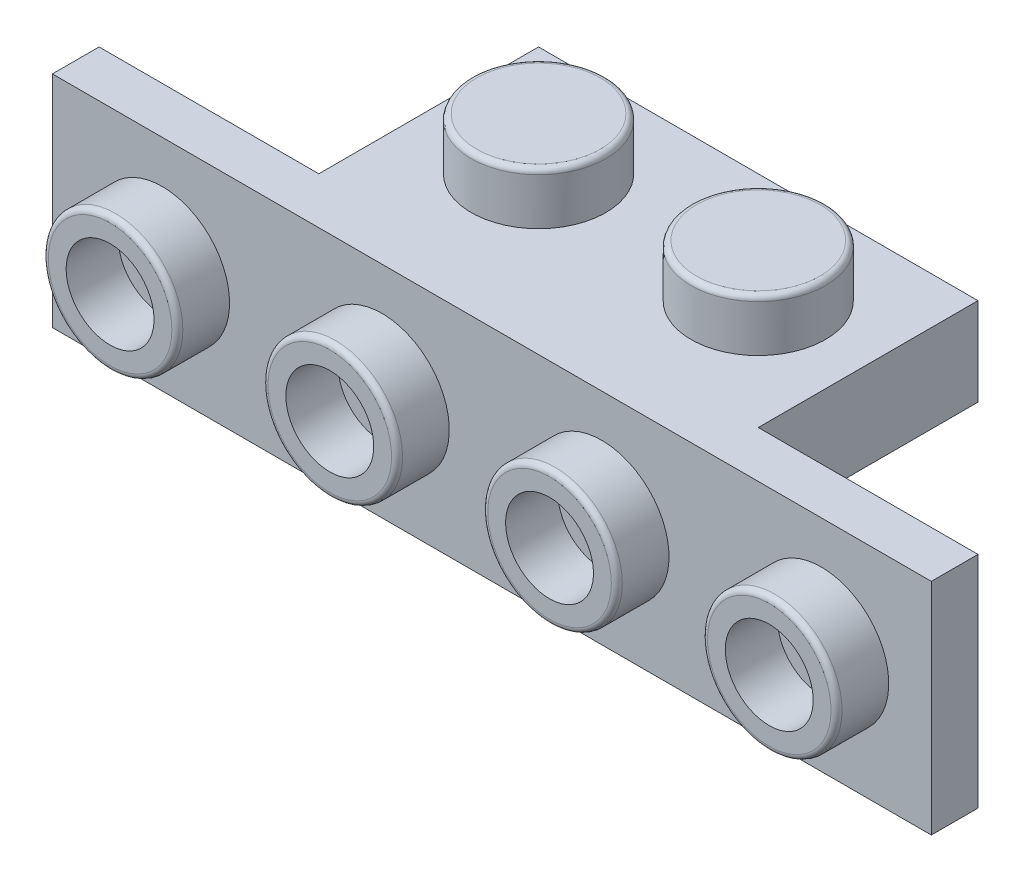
ISO-10303-21;
HEADER;
FILE_DESCRIPTION(('STEP AP214'),'2;1');
FILE_NAME('part.step','',(''),(''),'','','');
FILE_SCHEMA(('AUTOMOTIVE_DESIGN { 1 0 10303 214 1 1 1 1 }'));
ENDSEC;
DATA;
#1=APPLICATION_CONTEXT('core data for automotive mechanical design processes');
#2=APPLICATION_PROTOCOL_DEFINITION('international standard','automotive_design',2000,#1);
#3=PRODUCT_CONTEXT('',#1,'mechanical');
#4=PRODUCT('Part','Part','',(#3));
#5=PRODUCT_RELATED_PRODUCT_CATEGORY('part','',(#4));
#6=PRODUCT_DEFINITION_FORMATION('','',#4);
#7=PRODUCT_DEFINITION_CONTEXT('part definition',#1,'design');
#8=PRODUCT_DEFINITION('design','',#6,#7);
#9=PRODUCT_DEFINITION_SHAPE('','',#8);
#10=(LENGTH_UNIT() NAMED_UNIT(*) SI_UNIT(.MILLI.,.METRE.));
#11=(NAMED_UNIT(*) PLANE_ANGLE_UNIT() SI_UNIT($,.RADIAN.));
#12=(NAMED_UNIT(*) SI_UNIT($,.STERADIAN.) SOLID_ANGLE_UNIT());
#13=UNCERTAINTY_MEASURE_WITH_UNIT(LENGTH_MEASURE(1.E-05),#10,'distance_accuracy_value','');
#14=(GEOMETRIC_REPRESENTATION_CONTEXT(3) GLOBAL_UNCERTAINTY_ASSIGNED_CONTEXT((#13)) GLOBAL_UNIT_ASSIGNED_CONTEXT((#10,
#11,#12)) REPRESENTATION_CONTEXT('',''));
#15=CARTESIAN_POINT('',(0.,0.,0.));
#16=DIRECTION('',(0.,0.,1.));
#17=DIRECTION('',(1.,0.,0.));
#18=AXIS2_PLACEMENT_3D('',#15,#16,#17);
#19=CARTESIAN_POINT('',(14.4,2.1,0.));
#20=DIRECTION('',(0.,1.,0.));
#21=DIRECTION('',(0.,0.,1.));
#22=AXIS2_PLACEMENT_3D('',#19,#20,#21);
#23=PLANE('',#22);
#24=CARTESIAN_POINT('',(12.,2.1,-4.));
#25=DIRECTION('',(0.,-1.,0.));
#26=DIRECTION('',(0.,0.,-1.));
#27=AXIS2_PLACEMENT_3D('',#24,#25,#26);
#28=CIRCLE('',#27,1.6);
#29=CARTESIAN_POINT('',(12.,2.1,-5.6));
#30=VERTEX_POINT('',#29);
#31=EDGE_CURVE('E250',#30,#30,#28,.T.);
#32=ORIENTED_EDGE('',*,*,#31,.F.);
#33=EDGE_LOOP('',(#32));
#34=FACE_BOUND('',#33,.T.);
#35=CARTESIAN_POINT('',(4.,2.1,-4.));
#36=DIRECTION('',(0.,-1.,0.));
#37=DIRECTION('',(0.,0.,-1.));
#38=AXIS2_PLACEMENT_3D('',#35,#36,#37);
#39=CIRCLE('',#38,1.6);
#40=CARTESIAN_POINT('',(4.,2.1,-5.6));
#41=VERTEX_POINT('',#40);
#42=EDGE_CURVE('E256',#41,#41,#39,.T.);
#43=ORIENTED_EDGE('',*,*,#42,.F.);
#44=EDGE_LOOP('',(#43));
#45=FACE_BOUND('',#44,.T.);
#46=CARTESIAN_POINT('',(8.,2.1,-4.00018362));
#47=DIRECTION('',(0.,1.,0.));
#48=DIRECTION('',(0.,0.,1.));
#49=AXIS2_PLACEMENT_3D('',#46,#47,#48);
#50=CIRCLE('',#49,1.59999999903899);
#51=CARTESIAN_POINT('',(8.,2.1,-2.40018362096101));
#52=VERTEX_POINT('',#51);
#53=EDGE_CURVE('E466',#52,#52,#50,.F.);
#54=ORIENTED_EDGE('',*,*,#53,.F.);
#55=EDGE_LOOP('',(#54));
#56=FACE_BOUND('',#55,.T.);
#57=DIRECTION('',(0.,0.,-1.));
#58=VECTOR('',#57,1.);
#59=CARTESIAN_POINT('',(3.25,2.1,0.));
#60=LINE('',#59,#58);
#61=CARTESIAN_POINT('',(3.25,2.1,-0.500000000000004));
#62=VERTEX_POINT('',#61);
#63=CARTESIAN_POINT('',(3.25,2.1,-1.6));
#64=VERTEX_POINT('',#63);
#65=EDGE_CURVE('E548',#62,#64,#60,.T.);
#66=ORIENTED_EDGE('',*,*,#65,.F.);
#67=DIRECTION('',(-1.,0.,0.));
#68=VECTOR('',#67,1.);
#69=CARTESIAN_POINT('',(1.6,2.1,-0.500000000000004));
#70=LINE('',#69,#68);
#71=CARTESIAN_POINT('',(1.6,2.1,-0.500000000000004));
#72=VERTEX_POINT('',#71);
#73=EDGE_CURVE('E475',#62,#72,#70,.T.);
#74=ORIENTED_EDGE('',*,*,#73,.T.);
#75=DIRECTION('',(0.,0.,-1.));
#76=VECTOR('',#75,1.);
#77=CARTESIAN_POINT('',(1.6,2.1,0.));
#78=LINE('',#77,#76);
#79=CARTESIAN_POINT('',(1.6,2.1,-6.4));
#80=VERTEX_POINT('',#79);
#81=EDGE_CURVE('E274',#72,#80,#78,.T.);
#82=ORIENTED_EDGE('',*,*,#81,.T.);
#83=DIRECTION('',(1.,0.,0.));
#84=VECTOR('',#83,1.);
#85=CARTESIAN_POINT('',(14.4,2.1,-6.4));
#86=LINE('',#85,#84);
#87=CARTESIAN_POINT('',(14.4,2.1,-6.4));
#88=VERTEX_POINT('',#87);
#89=EDGE_CURVE('E276',#80,#88,#86,.T.);
#90=ORIENTED_EDGE('',*,*,#89,.T.);
#91=DIRECTION('',(0.,0.,1.));
#92=VECTOR('',#91,1.);
#93=CARTESIAN_POINT('',(14.4,2.1,0.));
#94=LINE('',#93,#92);
#95=CARTESIAN_POINT('',(14.4,2.1,-0.500000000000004));
#96=VERTEX_POINT('',#95);
#97=EDGE_CURVE('E271',#88,#96,#94,.T.);
#98=ORIENTED_EDGE('',*,*,#97,.T.);
#99=DIRECTION('',(-1.,0.,0.));
#100=VECTOR('',#99,1.);
#101=CARTESIAN_POINT('',(12.55,2.1,-0.500000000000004));
#102=LINE('',#101,#100);
#103=CARTESIAN_POINT('',(12.55,2.1,-0.500000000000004));
#104=VERTEX_POINT('',#103);
#105=EDGE_CURVE('E472',#96,#104,#102,.T.);
#106=ORIENTED_EDGE('',*,*,#105,.T.);
#107=DIRECTION('',(0.,0.,1.));
#108=VECTOR('',#107,1.);
#109=CARTESIAN_POINT('',(12.55,2.1,0.));
#110=LINE('',#109,#108);
#111=CARTESIAN_POINT('',(12.55,2.1,-1.6));
#112=VERTEX_POINT('',#111);
#113=EDGE_CURVE('E212',#112,#104,#110,.T.);
#114=ORIENTED_EDGE('',*,*,#113,.F.);
#115=DIRECTION('',(1.,0.,0.));
#116=VECTOR('',#115,1.);
#117=CARTESIAN_POINT('',(12.55,2.1,-1.6));
#118=LINE('',#117,#116);
#119=CARTESIAN_POINT('',(11.25,2.1,-1.6));
#120=VERTEX_POINT('',#119);
#121=EDGE_CURVE('E217',#120,#112,#118,.T.);
#122=ORIENTED_EDGE('',*,*,#121,.F.);
#123=DIRECTION('',(0.,0.,-1.));
#124=VECTOR('',#123,1.);
#125=CARTESIAN_POINT('',(11.25,2.1,0.));
#126=LINE('',#125,#124);
#127=CARTESIAN_POINT('',(11.25,2.1,-0.500000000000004));
#128=VERTEX_POINT('',#127);
#129=EDGE_CURVE('E215',#128,#120,#126,.T.);
#130=ORIENTED_EDGE('',*,*,#129,.F.);
#131=DIRECTION('',(-1.,0.,0.));
#132=VECTOR('',#131,1.);
#133=CARTESIAN_POINT('',(4.55,2.1,-0.500000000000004));
#134=LINE('',#133,#132);
#135=CARTESIAN_POINT('',(4.55,2.1,-0.500000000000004));
#136=VERTEX_POINT('',#135);
#137=EDGE_CURVE('E469',#128,#136,#134,.T.);
#138=ORIENTED_EDGE('',*,*,#137,.T.);
#139=DIRECTION('',(0.,0.,1.));
#140=VECTOR('',#139,1.);
#141=CARTESIAN_POINT('',(4.55,2.1,0.));
#142=LINE('',#141,#140);
#143=CARTESIAN_POINT('',(4.55,2.1,-1.6));
#144=VERTEX_POINT('',#143);
#145=EDGE_CURVE('E492',#144,#136,#142,.T.);
#146=ORIENTED_EDGE('',*,*,#145,.F.);
#147=DIRECTION('',(1.,0.,0.));
#148=VECTOR('',#147,1.);
#149=CARTESIAN_POINT('',(4.55,2.1,-1.6));
#150=LINE('',#149,#148);
#151=EDGE_CURVE('E550',#64,#144,#150,.T.);
#152=ORIENTED_EDGE('',*,*,#151,.F.);
#153=EDGE_LOOP('',(#66,#74,#82,#90,#98,#106,#114,#122,#130,#138,#146,#152));
#154=FACE_BOUND('',#153,.T.);
#155=ADVANCED_FACE('F27',(#34,#45,#56,#154),#23,.F.);
#156=CARTESIAN_POINT('',(-8.,3.2,0.));
#157=DIRECTION('',(0.,0.,1.));
#158=DIRECTION('',(1.,0.,0.));
#159=AXIS2_PLACEMENT_3D('',#156,#157,#158);
#160=PLANE('',#159);
#161=DIRECTION('',(0.,-1.,0.));
#162=VECTOR('',#161,1.);
#163=CARTESIAN_POINT('',(1.6,2.1,0.));
#164=LINE('',#163,#162);
#165=CARTESIAN_POINT('',(1.6,1.6,0.));
#166=VERTEX_POINT('',#165);
#167=CARTESIAN_POINT('',(1.6,0.,0.));
#168=VERTEX_POINT('',#167);
#169=EDGE_CURVE('E285',#166,#168,#164,.T.);
#170=ORIENTED_EDGE('',*,*,#169,.F.);
#171=DIRECTION('',(1.,0.,0.));
#172=VECTOR('',#171,1.);
#173=CARTESIAN_POINT('',(3.25,1.6,0.));
#174=LINE('',#173,#172);
#175=CARTESIAN_POINT('',(3.25,1.6,0.));
#176=VERTEX_POINT('',#175);
#177=EDGE_CURVE('E42',#166,#176,#174,.T.);
#178=ORIENTED_EDGE('',*,*,#177,.T.);
#179=DIRECTION('',(0.,1.,0.));
#180=VECTOR('',#179,1.);
#181=CARTESIAN_POINT('',(3.25,0.2,0.));
#182=LINE('',#181,#180);
#183=CARTESIAN_POINT('',(3.25,0.2,0.));
#184=VERTEX_POINT('',#183);
#185=EDGE_CURVE('E179',#184,#176,#182,.T.);
#186=ORIENTED_EDGE('',*,*,#185,.F.);
#187=DIRECTION('',(-1.,0.,0.));
#188=VECTOR('',#187,1.);
#189=CARTESIAN_POINT('',(4.55,0.2,0.));
#190=LINE('',#189,#188);
#191=CARTESIAN_POINT('',(4.55,0.200000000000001,0.));
#192=VERTEX_POINT('',#191);
#193=EDGE_CURVE('E183',#192,#184,#190,.T.);
#194=ORIENTED_EDGE('',*,*,#193,.F.);
#195=DIRECTION('',(0.,1.,0.));
#196=VECTOR('',#195,1.);
#197=CARTESIAN_POINT('',(4.55,0.2,0.));
#198=LINE('',#197,#196);
#199=CARTESIAN_POINT('',(4.55,1.6,0.));
#200=VERTEX_POINT('',#199);
#201=EDGE_CURVE('E188',#192,#200,#198,.T.);
#202=ORIENTED_EDGE('',*,*,#201,.T.);
#203=DIRECTION('',(1.,0.,0.));
#204=VECTOR('',#203,1.);
#205=CARTESIAN_POINT('',(11.25,1.6,0.));
#206=LINE('',#205,#204);
#207=CARTESIAN_POINT('',(11.25,1.6,0.));
#208=VERTEX_POINT('',#207);
#209=EDGE_CURVE('E480',#200,#208,#206,.T.);
#210=ORIENTED_EDGE('',*,*,#209,.T.);
#211=DIRECTION('',(0.,1.,0.));
#212=VECTOR('',#211,1.);
#213=CARTESIAN_POINT('',(11.25,0.2,0.));
#214=LINE('',#213,#212);
#215=CARTESIAN_POINT('',(11.25,0.2,0.));
#216=VERTEX_POINT('',#215);
#217=EDGE_CURVE('E236',#216,#208,#214,.T.);
#218=ORIENTED_EDGE('',*,*,#217,.F.);
#219=DIRECTION('',(-1.,0.,0.));
#220=VECTOR('',#219,1.);
#221=CARTESIAN_POINT('',(12.55,0.2,0.));
#222=LINE('',#221,#220);
#223=CARTESIAN_POINT('',(12.55,0.200000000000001,0.));
#224=VERTEX_POINT('',#223);
#225=EDGE_CURVE('E223',#224,#216,#222,.T.);
#226=ORIENTED_EDGE('',*,*,#225,.F.);
#227=DIRECTION('',(0.,1.,0.));
#228=VECTOR('',#227,1.);
#229=CARTESIAN_POINT('',(12.55,0.2,0.));
#230=LINE('',#229,#228);
#231=CARTESIAN_POINT('',(12.55,1.6,0.));
#232=VERTEX_POINT('',#231);
#233=EDGE_CURVE('E239',#224,#232,#230,.T.);
#234=ORIENTED_EDGE('',*,*,#233,.T.);
#235=DIRECTION('',(1.,0.,0.));
#236=VECTOR('',#235,1.);
#237=CARTESIAN_POINT('',(14.4,1.6,0.));
#238=LINE('',#237,#236);
#239=CARTESIAN_POINT('',(14.4,1.6,0.));
#240=VERTEX_POINT('',#239);
#241=EDGE_CURVE('E49',#232,#240,#238,.T.);
#242=ORIENTED_EDGE('',*,*,#241,.T.);
#243=DIRECTION('',(0.,-1.,0.));
#244=VECTOR('',#243,1.);
#245=CARTESIAN_POINT('',(14.4,2.1,0.));
#246=LINE('',#245,#244);
#247=CARTESIAN_POINT('',(14.4,0.,0.));
#248=VERTEX_POINT('',#247);
#249=EDGE_CURVE('E279',#240,#248,#246,.T.);
#250=ORIENTED_EDGE('',*,*,#249,.T.);
#251=DIRECTION('',(1.,0.,0.));
#252=VECTOR('',#251,1.);
#253=CARTESIAN_POINT('',(0.,0.,0.));
#254=LINE('',#253,#252);
#255=CARTESIAN_POINT('',(16.,0.,0.));
#256=VERTEX_POINT('',#255);
#257=EDGE_CURVE('E531',#248,#256,#254,.T.);
#258=ORIENTED_EDGE('',*,*,#257,.T.);
#259=DIRECTION('',(0.,-1.,0.));
#260=VECTOR('',#259,1.);
#261=CARTESIAN_POINT('',(16.,3.2,0.));
#262=LINE('',#261,#260);
#263=CARTESIAN_POINT('',(16.,3.2,0.));
#264=VERTEX_POINT('',#263);
#265=EDGE_CURVE('E374',#264,#256,#262,.T.);
#266=ORIENTED_EDGE('',*,*,#265,.F.);
#267=DIRECTION('',(-1.,0.,0.));
#268=VECTOR('',#267,1.);
#269=CARTESIAN_POINT('',(-8.,3.2,0.));
#270=LINE('',#269,#268);
#271=CARTESIAN_POINT('',(24.,3.2,0.));
#272=VERTEX_POINT('',#271);
#273=EDGE_CURVE('E327',#272,#264,#270,.T.);
#274=ORIENTED_EDGE('',*,*,#273,.F.);
#275=DIRECTION('',(0.,1.,0.));
#276=VECTOR('',#275,1.);
#277=CARTESIAN_POINT('',(24.,3.2,0.));
#278=LINE('',#277,#276);
#279=CARTESIAN_POINT('',(24.,-4.8,0.));
#280=VERTEX_POINT('',#279);
#281=EDGE_CURVE('E316',#280,#272,#278,.T.);
#282=ORIENTED_EDGE('',*,*,#281,.F.);
#283=DIRECTION('',(1.,0.,0.));
#284=VECTOR('',#283,1.);
#285=CARTESIAN_POINT('',(-7.99999999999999,-4.8,0.));
#286=LINE('',#285,#284);
#287=CARTESIAN_POINT('',(-7.99999999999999,-4.8,0.));
#288=VERTEX_POINT('',#287);
#289=EDGE_CURVE('E314',#288,#280,#286,.T.);
#290=ORIENTED_EDGE('',*,*,#289,.F.);
#291=DIRECTION('',(0.,-1.,0.));
#292=VECTOR('',#291,1.);
#293=CARTESIAN_POINT('',(-8.,3.2,0.));
#294=LINE('',#293,#292);
#295=CARTESIAN_POINT('',(-8.,3.2,0.));
#296=VERTEX_POINT('',#295);
#297=EDGE_CURVE('E311',#296,#288,#294,.T.);
#298=ORIENTED_EDGE('',*,*,#297,.F.);
#299=CARTESIAN_POINT('',(0.,3.2,0.));
#300=VERTEX_POINT('',#299);
#301=EDGE_CURVE('E318',#300,#296,#270,.T.);
#302=ORIENTED_EDGE('',*,*,#301,.F.);
#303=DIRECTION('',(0.,-1.,0.));
#304=VECTOR('',#303,1.);
#305=CARTESIAN_POINT('',(0.,3.2,0.));
#306=LINE('',#305,#304);
#307=CARTESIAN_POINT('',(0.,0.,0.));
#308=VERTEX_POINT('',#307);
#309=EDGE_CURVE('E406',#300,#308,#306,.T.);
#310=ORIENTED_EDGE('',*,*,#309,.T.);
#311=EDGE_CURVE('E533',#308,#168,#254,.T.);
#312=ORIENTED_EDGE('',*,*,#311,.T.);
#313=EDGE_LOOP('',(#170,#178,#186,#194,#202,#210,#218,#226,#234,#242,#250,#258,#266,#274,#282,
#290,#298,#302,#310,#312));
#314=FACE_BOUND('',#313,.T.);
#315=ADVANCED_FACE('F181',(#314),#160,.F.);
#316=CARTESIAN_POINT('',(-8.,3.2,1.7));
#317=DIRECTION('',(0.,0.,1.));
#318=DIRECTION('',(1.,0.,0.));
#319=AXIS2_PLACEMENT_3D('',#316,#317,#318);
#320=PLANE('',#319);
#321=DIRECTION('',(0.,-1.,0.));
#322=VECTOR('',#321,1.);
#323=CARTESIAN_POINT('',(-8.,3.2,1.7));
#324=LINE('',#323,#322);
#325=CARTESIAN_POINT('',(-8.,3.2,1.7));
#326=VERTEX_POINT('',#325);
#327=CARTESIAN_POINT('',(-7.99999999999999,-4.8,1.7));
#328=VERTEX_POINT('',#327);
#329=EDGE_CURVE('E321',#326,#328,#324,.T.);
#330=ORIENTED_EDGE('',*,*,#329,.T.);
#331=DIRECTION('',(1.,0.,0.));
#332=VECTOR('',#331,1.);
#333=CARTESIAN_POINT('',(-7.99999999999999,-4.8,1.7));
#334=LINE('',#333,#332);
#335=CARTESIAN_POINT('',(24.,-4.8,1.7));
#336=VERTEX_POINT('',#335);
#337=EDGE_CURVE('E346',#328,#336,#334,.T.);
#338=ORIENTED_EDGE('',*,*,#337,.T.);
#339=DIRECTION('',(0.,1.,0.));
#340=VECTOR('',#339,1.);
#341=CARTESIAN_POINT('',(24.,3.2,1.7));
#342=LINE('',#341,#340);
#343=CARTESIAN_POINT('',(24.,3.2,1.7));
#344=VERTEX_POINT('',#343);
#345=EDGE_CURVE('E345',#336,#344,#342,.T.);
#346=ORIENTED_EDGE('',*,*,#345,.T.);
#347=DIRECTION('',(-1.,0.,0.));
#348=VECTOR('',#347,1.);
#349=CARTESIAN_POINT('',(-8.,3.2,1.7));
#350=LINE('',#349,#348);
#351=EDGE_CURVE('E343',#344,#326,#350,.T.);
#352=ORIENTED_EDGE('',*,*,#351,.T.);
#353=EDGE_LOOP('',(#330,#338,#346,#352));
#354=FACE_BOUND('',#353,.T.);
#355=CARTESIAN_POINT('',(-4.,-0.800000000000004,1.7));
#356=DIRECTION('',(0.,0.,1.));
#357=DIRECTION('',(1.,0.,0.));
#358=AXIS2_PLACEMENT_3D('',#355,#356,#357);
#359=CIRCLE('',#358,2.45);
#360=CARTESIAN_POINT('',(-6.45,-0.800000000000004,1.7));
#361=VERTEX_POINT('',#360);
#362=EDGE_CURVE('E308',#361,#361,#359,.T.);
#363=ORIENTED_EDGE('',*,*,#362,.F.);
#364=EDGE_LOOP('',(#363));
#365=FACE_BOUND('',#364,.T.);
#366=CARTESIAN_POINT('',(4.,-0.800000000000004,1.7));
#367=DIRECTION('',(0.,0.,1.));
#368=DIRECTION('',(1.,0.,0.));
#369=AXIS2_PLACEMENT_3D('',#366,#367,#368);
#370=CIRCLE('',#369,2.45);
#371=CARTESIAN_POINT('',(1.55,-0.800000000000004,1.7));
#372=VERTEX_POINT('',#371);
#373=EDGE_CURVE('E302',#372,#372,#370,.T.);
#374=ORIENTED_EDGE('',*,*,#373,.F.);
#375=EDGE_LOOP('',(#374));
#376=FACE_BOUND('',#375,.T.);
#377=CARTESIAN_POINT('',(12.,-0.800000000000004,1.7));
#378=DIRECTION('',(0.,0.,1.));
#379=DIRECTION('',(1.,0.,0.));
#380=AXIS2_PLACEMENT_3D('',#377,#378,#379);
#381=CIRCLE('',#380,2.45);
#382=CARTESIAN_POINT('',(9.55,-0.800000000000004,1.7));
#383=VERTEX_POINT('',#382);
#384=EDGE_CURVE('E296',#383,#383,#381,.T.);
#385=ORIENTED_EDGE('',*,*,#384,.F.);
#386=EDGE_LOOP('',(#385));
#387=FACE_BOUND('',#386,.T.);
#388=CARTESIAN_POINT('',(20.,-0.800000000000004,1.7));
#389=DIRECTION('',(0.,0.,1.));
#390=DIRECTION('',(1.,0.,0.));
#391=AXIS2_PLACEMENT_3D('',#388,#389,#390);
#392=CIRCLE('',#391,2.45);
#393=CARTESIAN_POINT('',(17.55,-0.800000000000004,1.7));
#394=VERTEX_POINT('',#393);
#395=EDGE_CURVE('E290',#394,#394,#392,.T.);
#396=ORIENTED_EDGE('',*,*,#395,.F.);
#397=EDGE_LOOP('',(#396));
#398=FACE_BOUND('',#397,.T.);
#399=ADVANCED_FACE('F352',(#354,#365,#376,#387,#398),#320,.T.);
#400=CARTESIAN_POINT('',(0.,3.2,-8.));
#401=DIRECTION('',(0.,-1.,0.));
#402=DIRECTION('',(0.,0.,-1.));
#403=AXIS2_PLACEMENT_3D('',#400,#401,#402);
#404=PLANE('',#403);
#405=CARTESIAN_POINT('',(12.,3.2,-4.));
#406=DIRECTION('',(0.,-1.,0.));
#407=DIRECTION('',(0.,0.,-1.));
#408=AXIS2_PLACEMENT_3D('',#405,#406,#407);
#409=CIRCLE('',#408,2.45);
#410=CARTESIAN_POINT('',(12.,3.2,-6.45));
#411=VERTEX_POINT('',#410);
#412=EDGE_CURVE('E412',#411,#411,#409,.F.);
#413=ORIENTED_EDGE('',*,*,#412,.F.);
#414=EDGE_LOOP('',(#413));
#415=FACE_BOUND('',#414,.T.);
#416=DIRECTION('',(0.,0.,1.));
#417=VECTOR('',#416,1.);
#418=CARTESIAN_POINT('',(0.,3.2,0.));
#419=LINE('',#418,#417);
#420=CARTESIAN_POINT('',(0.,3.2,-8.));
#421=VERTEX_POINT('',#420);
#422=EDGE_CURVE('E381',#421,#300,#419,.T.);
#423=ORIENTED_EDGE('',*,*,#422,.T.);
#424=ORIENTED_EDGE('',*,*,#301,.T.);
#425=DIRECTION('',(0.,0.,-1.));
#426=VECTOR('',#425,1.);
#427=CARTESIAN_POINT('',(-8.,3.2,1.7));
#428=LINE('',#427,#426);
#429=EDGE_CURVE('E340',#326,#296,#428,.T.);
#430=ORIENTED_EDGE('',*,*,#429,.F.);
#431=ORIENTED_EDGE('',*,*,#351,.F.);
#432=DIRECTION('',(0.,0.,-1.));
#433=VECTOR('',#432,1.);
#434=CARTESIAN_POINT('',(24.,3.2,1.7));
#435=LINE('',#434,#433);
#436=EDGE_CURVE('E337',#344,#272,#435,.T.);
#437=ORIENTED_EDGE('',*,*,#436,.T.);
#438=ORIENTED_EDGE('',*,*,#273,.T.);
#439=DIRECTION('',(0.,0.,-1.));
#440=VECTOR('',#439,1.);
#441=CARTESIAN_POINT('',(16.,3.2,0.));
#442=LINE('',#441,#440);
#443=CARTESIAN_POINT('',(16.,3.2,-8.));
#444=VERTEX_POINT('',#443);
#445=EDGE_CURVE('E375',#264,#444,#442,.T.);
#446=ORIENTED_EDGE('',*,*,#445,.T.);
#447=DIRECTION('',(-1.,0.,0.));
#448=VECTOR('',#447,1.);
#449=CARTESIAN_POINT('',(0.,3.2,-8.));
#450=LINE('',#449,#448);
#451=EDGE_CURVE('E378',#444,#421,#450,.T.);
#452=ORIENTED_EDGE('',*,*,#451,.T.);
#453=EDGE_LOOP('',(#423,#424,#430,#431,#437,#438,#446,#452));
#454=FACE_BOUND('',#453,.T.);
#455=CARTESIAN_POINT('',(4.,3.2,-4.));
#456=DIRECTION('',(0.,-1.,0.));
#457=DIRECTION('',(0.,0.,-1.));
#458=AXIS2_PLACEMENT_3D('',#455,#456,#457);
#459=CIRCLE('',#458,2.45);
#460=CARTESIAN_POINT('',(4.,3.2,-6.45));
#461=VERTEX_POINT('',#460);
#462=EDGE_CURVE('E415',#461,#461,#459,.F.);
#463=ORIENTED_EDGE('',*,*,#462,.F.);
#464=EDGE_LOOP('',(#463));
#465=FACE_BOUND('',#464,.T.);
#466=ADVANCED_FACE('F368',(#415,#454,#465),#404,.F.);
#467=CARTESIAN_POINT('',(0.,3.2,0.));
#468=DIRECTION('',(1.,0.,0.));
#469=DIRECTION('',(0.,0.,-1.));
#470=AXIS2_PLACEMENT_3D('',#467,#468,#469);
#471=PLANE('',#470);
#472=DIRECTION('',(0.,0.,1.));
#473=VECTOR('',#472,1.);
#474=CARTESIAN_POINT('',(0.,0.,0.));
#475=LINE('',#474,#473);
#476=CARTESIAN_POINT('',(0.,0.,-8.));
#477=VERTEX_POINT('',#476);
#478=EDGE_CURVE('E333',#477,#308,#475,.T.);
#479=ORIENTED_EDGE('',*,*,#478,.T.);
#480=ORIENTED_EDGE('',*,*,#309,.F.);
#481=ORIENTED_EDGE('',*,*,#422,.F.);
#482=DIRECTION('',(0.,-1.,0.));
#483=VECTOR('',#482,1.);
#484=CARTESIAN_POINT('',(0.,3.2,-8.));
#485=LINE('',#484,#483);
#486=EDGE_CURVE('E390',#421,#477,#485,.T.);
#487=ORIENTED_EDGE('',*,*,#486,.T.);
#488=EDGE_LOOP('',(#479,#480,#481,#487));
#489=FACE_BOUND('',#488,.T.);
#490=ADVANCED_FACE('F29',(#489),#471,.F.);
#491=CARTESIAN_POINT('',(16.,3.2,0.));
#492=DIRECTION('',(-1.,0.,0.));
#493=DIRECTION('',(0.,0.,1.));
#494=AXIS2_PLACEMENT_3D('',#491,#492,#493);
#495=PLANE('',#494);
#496=DIRECTION('',(0.,0.,-1.));
#497=VECTOR('',#496,1.);
#498=CARTESIAN_POINT('',(16.,0.,0.));
#499=LINE('',#498,#497);
#500=CARTESIAN_POINT('',(16.,0.,-8.));
#501=VERTEX_POINT('',#500);
#502=EDGE_CURVE('E387',#256,#501,#499,.T.);
#503=ORIENTED_EDGE('',*,*,#502,.T.);
#504=DIRECTION('',(0.,-1.,0.));
#505=VECTOR('',#504,1.);
#506=CARTESIAN_POINT('',(16.,3.2,-8.));
#507=LINE('',#506,#505);
#508=EDGE_CURVE('E384',#444,#501,#507,.T.);
#509=ORIENTED_EDGE('',*,*,#508,.F.);
#510=ORIENTED_EDGE('',*,*,#445,.F.);
#511=ORIENTED_EDGE('',*,*,#265,.T.);
#512=EDGE_LOOP('',(#503,#509,#510,#511));
#513=FACE_BOUND('',#512,.T.);
#514=ADVANCED_FACE('F385',(#513),#495,.F.);
#515=CARTESIAN_POINT('',(0.,3.2,-8.));
#516=DIRECTION('',(0.,0.,1.));
#517=DIRECTION('',(1.,0.,0.));
#518=AXIS2_PLACEMENT_3D('',#515,#516,#517);
#519=PLANE('',#518);
#520=DIRECTION('',(-1.,0.,0.));
#521=VECTOR('',#520,1.);
#522=CARTESIAN_POINT('',(0.,0.,-8.));
#523=LINE('',#522,#521);
#524=EDGE_CURVE('E398',#501,#477,#523,.T.);
#525=ORIENTED_EDGE('',*,*,#524,.T.);
#526=ORIENTED_EDGE('',*,*,#486,.F.);
#527=ORIENTED_EDGE('',*,*,#451,.F.);
#528=ORIENTED_EDGE('',*,*,#508,.T.);
#529=EDGE_LOOP('',(#525,#526,#527,#528));
#530=FACE_BOUND('',#529,.T.);
#531=ADVANCED_FACE('F392',(#530),#519,.F.);
#532=CARTESIAN_POINT('',(0.,0.,-8.));
#533=DIRECTION('',(0.,-1.,0.));
#534=DIRECTION('',(0.,0.,-1.));
#535=AXIS2_PLACEMENT_3D('',#532,#533,#534);
#536=PLANE('',#535);
#537=DIRECTION('',(0.,0.,1.));
#538=VECTOR('',#537,1.);
#539=CARTESIAN_POINT('',(14.4,0.,0.));
#540=LINE('',#539,#538);
#541=CARTESIAN_POINT('',(14.4,0.,-6.4));
#542=VERTEX_POINT('',#541);
#543=EDGE_CURVE('E262',#542,#248,#540,.T.);
#544=ORIENTED_EDGE('',*,*,#543,.F.);
#545=DIRECTION('',(1.,0.,0.));
#546=VECTOR('',#545,1.);
#547=CARTESIAN_POINT('',(14.4,0.,-6.4));
#548=LINE('',#547,#546);
#549=CARTESIAN_POINT('',(1.6,0.,-6.4));
#550=VERTEX_POINT('',#549);
#551=EDGE_CURVE('E268',#550,#542,#548,.T.);
#552=ORIENTED_EDGE('',*,*,#551,.F.);
#553=DIRECTION('',(0.,0.,-1.));
#554=VECTOR('',#553,1.);
#555=CARTESIAN_POINT('',(1.6,0.,0.));
#556=LINE('',#555,#554);
#557=EDGE_CURVE('E265',#168,#550,#556,.T.);
#558=ORIENTED_EDGE('',*,*,#557,.F.);
#559=ORIENTED_EDGE('',*,*,#311,.F.);
#560=ORIENTED_EDGE('',*,*,#478,.F.);
#561=ORIENTED_EDGE('',*,*,#524,.F.);
#562=ORIENTED_EDGE('',*,*,#502,.F.);
#563=ORIENTED_EDGE('',*,*,#257,.F.);
#564=EDGE_LOOP('',(#544,#552,#558,#559,#560,#561,#562,#563));
#565=FACE_BOUND('',#564,.T.);
#566=ADVANCED_FACE('F532',(#565),#536,.T.);
#567=CARTESIAN_POINT('',(-8.,3.2,1.7));
#568=DIRECTION('',(1.,0.,0.));
#569=DIRECTION('',(0.,1.,0.));
#570=AXIS2_PLACEMENT_3D('',#567,#568,#569);
#571=PLANE('',#570);
#572=ORIENTED_EDGE('',*,*,#297,.T.);
#573=DIRECTION('',(0.,0.,-1.));
#574=VECTOR('',#573,1.);
#575=CARTESIAN_POINT('',(-7.99999999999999,-4.8,1.7));
#576=LINE('',#575,#574);
#577=EDGE_CURVE('E330',#328,#288,#576,.T.);
#578=ORIENTED_EDGE('',*,*,#577,.F.);
#579=ORIENTED_EDGE('',*,*,#329,.F.);
#580=ORIENTED_EDGE('',*,*,#429,.T.);
#581=EDGE_LOOP('',(#572,#578,#579,#580));
#582=FACE_BOUND('',#581,.T.);
#583=ADVANCED_FACE('F357',(#582),#571,.F.);
#584=CARTESIAN_POINT('',(-7.99999999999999,-4.8,1.7));
#585=DIRECTION('',(0.,1.,0.));
#586=DIRECTION('',(0.,0.,1.));
#587=AXIS2_PLACEMENT_3D('',#584,#585,#586);
#588=PLANE('',#587);
#589=ORIENTED_EDGE('',*,*,#289,.T.);
#590=DIRECTION('',(0.,0.,-1.));
#591=VECTOR('',#590,1.);
#592=CARTESIAN_POINT('',(24.,-4.8,1.7));
#593=LINE('',#592,#591);
#594=EDGE_CURVE('E334',#336,#280,#593,.T.);
#595=ORIENTED_EDGE('',*,*,#594,.F.);
#596=ORIENTED_EDGE('',*,*,#337,.F.);
#597=ORIENTED_EDGE('',*,*,#577,.T.);
#598=EDGE_LOOP('',(#589,#595,#596,#597));
#599=FACE_BOUND('',#598,.T.);
#600=ADVANCED_FACE('F360',(#599),#588,.F.);
#601=CARTESIAN_POINT('',(24.,3.2,1.7));
#602=DIRECTION('',(-1.,0.,0.));
#603=DIRECTION('',(0.,0.,1.));
#604=AXIS2_PLACEMENT_3D('',#601,#602,#603);
#605=PLANE('',#604);
#606=ORIENTED_EDGE('',*,*,#281,.T.);
#607=ORIENTED_EDGE('',*,*,#436,.F.);
#608=ORIENTED_EDGE('',*,*,#345,.F.);
#609=ORIENTED_EDGE('',*,*,#594,.T.);
#610=EDGE_LOOP('',(#606,#607,#608,#609));
#611=FACE_BOUND('',#610,.T.);
#612=ADVANCED_FACE('F365',(#611),#605,.F.);
#613=CARTESIAN_POINT('',(12.,5.1,-4.));
#614=DIRECTION('',(0.,-1.,0.));
#615=DIRECTION('',(0.,0.,-1.));
#616=AXIS2_PLACEMENT_3D('',#613,#614,#615);
#617=CYLINDRICAL_SURFACE('',#616,2.45);
#618=CARTESIAN_POINT('',(12.,4.9,-4.));
#619=DIRECTION('',(0.,1.,0.));
#620=DIRECTION('',(0.,0.,1.));
#621=AXIS2_PLACEMENT_3D('',#618,#619,#620);
#622=CIRCLE('',#621,2.45);
#623=CARTESIAN_POINT('',(12.,4.9,-6.45));
#624=VERTEX_POINT('',#623);
#625=EDGE_CURVE('E421',#624,#624,#622,.F.);
#626=CARTESIAN_POINT('',(12.,4.9,-6.45));
#627=CARTESIAN_POINT('',(12.,4.88229166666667,-6.45));
#628=CARTESIAN_POINT('',(12.,4.86458333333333,-6.45));
#629=CARTESIAN_POINT('',(12.,4.82916666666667,-6.45));
#630=CARTESIAN_POINT('',(12.,4.81145833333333,-6.45));
#631=CARTESIAN_POINT('',(12.,4.77604166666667,-6.45));
#632=CARTESIAN_POINT('',(12.,4.75833333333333,-6.45));
#633=CARTESIAN_POINT('',(12.,4.72291666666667,-6.45));
#634=CARTESIAN_POINT('',(12.,4.70520833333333,-6.45));
#635=CARTESIAN_POINT('',(12.,4.66979166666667,-6.45));
#636=CARTESIAN_POINT('',(12.,4.65208333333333,-6.45));
#637=CARTESIAN_POINT('',(12.,4.61666666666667,-6.45));
#638=CARTESIAN_POINT('',(12.,4.59895833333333,-6.45));
#639=CARTESIAN_POINT('',(12.,4.56354166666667,-6.45));
#640=CARTESIAN_POINT('',(12.,4.54583333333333,-6.45));
#641=CARTESIAN_POINT('',(12.,4.51041666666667,-6.45));
#642=CARTESIAN_POINT('',(12.,4.49270833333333,-6.45));
#643=CARTESIAN_POINT('',(12.,4.45729166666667,-6.45));
#644=CARTESIAN_POINT('',(12.,4.43958333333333,-6.45));
#645=CARTESIAN_POINT('',(12.,4.40416666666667,-6.45));
#646=CARTESIAN_POINT('',(12.,4.38645833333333,-6.45));
#647=CARTESIAN_POINT('',(12.,4.35104166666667,-6.45));
#648=CARTESIAN_POINT('',(12.,4.33333333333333,-6.45));
#649=CARTESIAN_POINT('',(12.,4.29791666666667,-6.45));
#650=CARTESIAN_POINT('',(12.,4.28020833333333,-6.45));
#651=CARTESIAN_POINT('',(12.,4.24479166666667,-6.45));
#652=CARTESIAN_POINT('',(12.,4.22708333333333,-6.45));
#653=CARTESIAN_POINT('',(12.,4.19166666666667,-6.45));
#654=CARTESIAN_POINT('',(12.,4.17395833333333,-6.45));
#655=CARTESIAN_POINT('',(12.,4.13854166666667,-6.45));
#656=CARTESIAN_POINT('',(12.,4.12083333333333,-6.45));
#657=CARTESIAN_POINT('',(12.,4.08541666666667,-6.45));
#658=CARTESIAN_POINT('',(12.,4.06770833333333,-6.45));
#659=CARTESIAN_POINT('',(12.,4.03229166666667,-6.45));
#660=CARTESIAN_POINT('',(12.,4.01458333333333,-6.45));
#661=CARTESIAN_POINT('',(12.,3.97916666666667,-6.45));
#662=CARTESIAN_POINT('',(12.,3.96145833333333,-6.45));
#663=CARTESIAN_POINT('',(12.,3.92604166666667,-6.45));
#664=CARTESIAN_POINT('',(12.,3.90833333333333,-6.45));
#665=CARTESIAN_POINT('',(12.,3.87291666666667,-6.45));
#666=CARTESIAN_POINT('',(12.,3.85520833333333,-6.45));
#667=CARTESIAN_POINT('',(12.,3.81979166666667,-6.45));
#668=CARTESIAN_POINT('',(12.,3.80208333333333,-6.45));
#669=CARTESIAN_POINT('',(12.,3.76666666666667,-6.45));
#670=CARTESIAN_POINT('',(12.,3.74895833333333,-6.45));
#671=CARTESIAN_POINT('',(12.,3.71354166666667,-6.45));
#672=CARTESIAN_POINT('',(12.,3.69583333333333,-6.45));
#673=CARTESIAN_POINT('',(12.,3.66041666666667,-6.45));
#674=CARTESIAN_POINT('',(12.,3.64270833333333,-6.45));
#675=CARTESIAN_POINT('',(12.,3.60729166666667,-6.45));
#676=CARTESIAN_POINT('',(12.,3.58958333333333,-6.45));
#677=CARTESIAN_POINT('',(12.,3.55416666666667,-6.45));
#678=CARTESIAN_POINT('',(12.,3.53645833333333,-6.45));
#679=CARTESIAN_POINT('',(12.,3.50104166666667,-6.45));
#680=CARTESIAN_POINT('',(12.,3.48333333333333,-6.45));
#681=CARTESIAN_POINT('',(12.,3.44791666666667,-6.45));
#682=CARTESIAN_POINT('',(12.,3.43020833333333,-6.45));
#683=CARTESIAN_POINT('',(12.,3.39479166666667,-6.45));
#684=CARTESIAN_POINT('',(12.,3.37708333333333,-6.45));
#685=CARTESIAN_POINT('',(12.,3.34166666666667,-6.45));
#686=CARTESIAN_POINT('',(12.,3.32395833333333,-6.45));
#687=CARTESIAN_POINT('',(12.,3.28854166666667,-6.45));
#688=CARTESIAN_POINT('',(12.,3.27083333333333,-6.45));
#689=CARTESIAN_POINT('',(12.,3.23541666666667,-6.45));
#690=CARTESIAN_POINT('',(12.,3.21770833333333,-6.45));
#691=CARTESIAN_POINT('',(12.,3.2,-6.45));
#692=B_SPLINE_CURVE_WITH_KNOTS('',3,(#626,#627,#628,#629,#630,#631,#632,#633,#634,#635,#636,
#637,#638,#639,#640,#641,#642,#643,#644,#645,#646,#647,#648,#649,#650,#651,#652,#653,#654,#655,
#656,#657,#658,#659,#660,#661,#662,#663,#664,#665,#666,#667,#668,#669,#670,#671,#672,#673,#674,
#675,#676,#677,#678,#679,#680,#681,#682,#683,#684,#685,#686,#687,#688,#689,#690,#691),
.UNSPECIFIED.,.F.,.F.,(4,2,2,2,2,2,2,2,2,2,2,2,2,2,2,2,2,2,2,2,2,2,2,2,2,2,2,2,2,2,2,2,4),(0.,
0.0531250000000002,0.10625,0.159375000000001,0.2125,0.265625,0.31875,0.371875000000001,0.425,
0.478125,0.53125,0.584375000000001,0.6375,0.690625,0.74375,0.796875,0.85,0.903125,0.95625,
1.009375,1.0625,1.115625,1.16875,1.221875,1.275,1.328125,1.38125,1.434375,1.4875,1.540625,
1.59375,1.646875,1.7),.UNSPECIFIED.);
#693=EDGE_CURVE('BSEAM721',#624,#411,#692,.T.);
#694=ORIENTED_EDGE('',*,*,#625,.T.);
#695=ORIENTED_EDGE('',*,*,#412,.T.);
#696=ORIENTED_EDGE('',*,*,#693,.T.);
#697=ORIENTED_EDGE('',*,*,#693,.F.);
#698=EDGE_LOOP('',(#694,#696,#695,#697));
#699=FACE_BOUND('',#698,.T.);
#700=ADVANCED_FACE('F721',(#699),#617,.T.);
#701=CARTESIAN_POINT('',(12.,5.1,-4.));
#702=DIRECTION('',(0.,1.,0.));
#703=DIRECTION('',(0.,0.,1.));
#704=AXIS2_PLACEMENT_3D('',#701,#702,#703);
#705=PLANE('',#704);
#706=CARTESIAN_POINT('',(12.,5.1,-4.));
#707=DIRECTION('',(0.,1.,0.));
#708=DIRECTION('',(0.,0.,1.));
#709=AXIS2_PLACEMENT_3D('',#706,#707,#708);
#710=CIRCLE('',#709,2.25);
#711=CARTESIAN_POINT('',(12.,5.1,-1.75));
#712=VERTEX_POINT('',#711);
#713=EDGE_CURVE('E418',#712,#712,#710,.T.);
#714=ORIENTED_EDGE('',*,*,#713,.T.);
#715=EDGE_LOOP('',(#714));
#716=FACE_BOUND('',#715,.T.);
#717=ADVANCED_FACE('F717',(#716),#705,.T.);
#718=CARTESIAN_POINT('',(4.,5.1,-4.));
#719=DIRECTION('',(0.,-1.,0.));
#720=DIRECTION('',(0.,0.,-1.));
#721=AXIS2_PLACEMENT_3D('',#718,#719,#720);
#722=CYLINDRICAL_SURFACE('',#721,2.45);
#723=CARTESIAN_POINT('',(4.,4.9,-4.));
#724=DIRECTION('',(0.,1.,0.));
#725=DIRECTION('',(0.,0.,1.));
#726=AXIS2_PLACEMENT_3D('',#723,#724,#725);
#727=CIRCLE('',#726,2.45);
#728=CARTESIAN_POINT('',(4.,4.9,-6.45));
#729=VERTEX_POINT('',#728);
#730=EDGE_CURVE('E427',#729,#729,#727,.F.);
#731=CARTESIAN_POINT('',(4.,4.9,-6.45));
#732=CARTESIAN_POINT('',(4.,4.88229166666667,-6.45));
#733=CARTESIAN_POINT('',(4.,4.86458333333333,-6.45));
#734=CARTESIAN_POINT('',(4.,4.82916666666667,-6.45));
#735=CARTESIAN_POINT('',(4.,4.81145833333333,-6.45));
#736=CARTESIAN_POINT('',(4.,4.77604166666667,-6.45));
#737=CARTESIAN_POINT('',(4.,4.75833333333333,-6.45));
#738=CARTESIAN_POINT('',(4.,4.72291666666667,-6.45));
#739=CARTESIAN_POINT('',(4.,4.70520833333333,-6.45));
#740=CARTESIAN_POINT('',(4.,4.66979166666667,-6.45));
#741=CARTESIAN_POINT('',(4.,4.65208333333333,-6.45));
#742=CARTESIAN_POINT('',(4.,4.61666666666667,-6.45));
#743=CARTESIAN_POINT('',(4.,4.59895833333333,-6.45));
#744=CARTESIAN_POINT('',(4.,4.56354166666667,-6.45));
#745=CARTESIAN_POINT('',(4.,4.54583333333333,-6.45));
#746=CARTESIAN_POINT('',(4.,4.51041666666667,-6.45));
#747=CARTESIAN_POINT('',(4.,4.49270833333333,-6.45));
#748=CARTESIAN_POINT('',(4.,4.45729166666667,-6.45));
#749=CARTESIAN_POINT('',(4.,4.43958333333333,-6.45));
#750=CARTESIAN_POINT('',(4.,4.40416666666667,-6.45));
#751=CARTESIAN_POINT('',(4.,4.38645833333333,-6.45));
#752=CARTESIAN_POINT('',(4.,4.35104166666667,-6.45));
#753=CARTESIAN_POINT('',(4.,4.33333333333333,-6.45));
#754=CARTESIAN_POINT('',(4.,4.29791666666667,-6.45));
#755=CARTESIAN_POINT('',(4.,4.28020833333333,-6.45));
#756=CARTESIAN_POINT('',(4.,4.24479166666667,-6.45));
#757=CARTESIAN_POINT('',(4.,4.22708333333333,-6.45));
#758=CARTESIAN_POINT('',(4.,4.19166666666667,-6.45));
#759=CARTESIAN_POINT('',(4.,4.17395833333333,-6.45));
#760=CARTESIAN_POINT('',(4.,4.13854166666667,-6.45));
#761=CARTESIAN_POINT('',(4.,4.12083333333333,-6.45));
#762=CARTESIAN_POINT('',(4.,4.08541666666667,-6.45));
#763=CARTESIAN_POINT('',(4.,4.06770833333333,-6.45));
#764=CARTESIAN_POINT('',(4.,4.03229166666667,-6.45));
#765=CARTESIAN_POINT('',(4.,4.01458333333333,-6.45));
#766=CARTESIAN_POINT('',(4.,3.97916666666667,-6.45));
#767=CARTESIAN_POINT('',(4.,3.96145833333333,-6.45));
#768=CARTESIAN_POINT('',(4.,3.92604166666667,-6.45));
#769=CARTESIAN_POINT('',(4.,3.90833333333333,-6.45));
#770=CARTESIAN_POINT('',(4.,3.87291666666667,-6.45));
#771=CARTESIAN_POINT('',(4.,3.85520833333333,-6.45));
#772=CARTESIAN_POINT('',(4.,3.81979166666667,-6.45));
#773=CARTESIAN_POINT('',(4.,3.80208333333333,-6.45));
#774=CARTESIAN_POINT('',(4.,3.76666666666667,-6.45));
#775=CARTESIAN_POINT('',(4.,3.74895833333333,-6.45));
#776=CARTESIAN_POINT('',(4.,3.71354166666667,-6.45));
#777=CARTESIAN_POINT('',(4.,3.69583333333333,-6.45));
#778=CARTESIAN_POINT('',(4.,3.66041666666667,-6.45));
#779=CARTESIAN_POINT('',(4.,3.64270833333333,-6.45));
#780=CARTESIAN_POINT('',(4.,3.60729166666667,-6.45));
#781=CARTESIAN_POINT('',(4.,3.58958333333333,-6.45));
#782=CARTESIAN_POINT('',(4.,3.55416666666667,-6.45));
#783=CARTESIAN_POINT('',(4.,3.53645833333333,-6.45));
#784=CARTESIAN_POINT('',(4.,3.50104166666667,-6.45));
#785=CARTESIAN_POINT('',(4.,3.48333333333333,-6.45));
#786=CARTESIAN_POINT('',(4.,3.44791666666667,-6.45));
#787=CARTESIAN_POINT('',(4.,3.43020833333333,-6.45));
#788=CARTESIAN_POINT('',(4.,3.39479166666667,-6.45));
#789=CARTESIAN_POINT('',(4.,3.37708333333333,-6.45));
#790=CARTESIAN_POINT('',(4.,3.34166666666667,-6.45));
#791=CARTESIAN_POINT('',(4.,3.32395833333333,-6.45));
#792=CARTESIAN_POINT('',(4.,3.28854166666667,-6.45));
#793=CARTESIAN_POINT('',(4.,3.27083333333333,-6.45));
#794=CARTESIAN_POINT('',(4.,3.23541666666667,-6.45));
#795=CARTESIAN_POINT('',(4.,3.21770833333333,-6.45));
#796=CARTESIAN_POINT('',(4.,3.2,-6.45));
#797=B_SPLINE_CURVE_WITH_KNOTS('',3,(#731,#732,#733,#734,#735,#736,#737,#738,#739,#740,#741,
#742,#743,#744,#745,#746,#747,#748,#749,#750,#751,#752,#753,#754,#755,#756,#757,#758,#759,#760,
#761,#762,#763,#764,#765,#766,#767,#768,#769,#770,#771,#772,#773,#774,#775,#776,#777,#778,#779,
#780,#781,#782,#783,#784,#785,#786,#787,#788,#789,#790,#791,#792,#793,#794,#795,#796),
.UNSPECIFIED.,.F.,.F.,(4,2,2,2,2,2,2,2,2,2,2,2,2,2,2,2,2,2,2,2,2,2,2,2,2,2,2,2,2,2,2,2,4),(0.,
0.0531250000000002,0.10625,0.159375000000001,0.2125,0.265625,0.31875,0.371875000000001,0.425,
0.478125,0.53125,0.584375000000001,0.6375,0.690625,0.74375,0.796875,0.85,0.903125,0.95625,
1.009375,1.0625,1.115625,1.16875,1.221875,1.275,1.328125,1.38125,1.434375,1.4875,1.540625,
1.59375,1.646875,1.7),.UNSPECIFIED.);
#798=EDGE_CURVE('BSEAM713',#729,#461,#797,.T.);
#799=ORIENTED_EDGE('',*,*,#730,.T.);
#800=ORIENTED_EDGE('',*,*,#462,.T.);
#801=ORIENTED_EDGE('',*,*,#798,.T.);
#802=ORIENTED_EDGE('',*,*,#798,.F.);
#803=EDGE_LOOP('',(#799,#801,#800,#802));
#804=FACE_BOUND('',#803,.T.);
#805=ADVANCED_FACE('F713',(#804),#722,.T.);
#806=CARTESIAN_POINT('',(4.,5.1,-4.));
#807=DIRECTION('',(0.,1.,0.));
#808=DIRECTION('',(0.,0.,1.));
#809=AXIS2_PLACEMENT_3D('',#806,#807,#808);
#810=PLANE('',#809);
#811=CARTESIAN_POINT('',(4.,5.1,-4.));
#812=DIRECTION('',(0.,1.,0.));
#813=DIRECTION('',(0.,0.,1.));
#814=AXIS2_PLACEMENT_3D('',#811,#812,#813);
#815=CIRCLE('',#814,2.25);
#816=CARTESIAN_POINT('',(4.,5.1,-1.75));
#817=VERTEX_POINT('',#816);
#818=EDGE_CURVE('E424',#817,#817,#815,.T.);
#819=ORIENTED_EDGE('',*,*,#818,.T.);
#820=EDGE_LOOP('',(#819));
#821=FACE_BOUND('',#820,.T.);
#822=ADVANCED_FACE('F709',(#821),#810,.T.);
#823=CARTESIAN_POINT('',(12.,4.9,-4.));
#824=DIRECTION('',(0.,1.,0.));
#825=DIRECTION('',(0.,0.,1.));
#826=AXIS2_PLACEMENT_3D('',#823,#824,#825);
#827=TOROIDAL_SURFACE('',#826,2.25,0.2);
#828=ORIENTED_EDGE('',*,*,#625,.F.);
#829=EDGE_LOOP('',(#828));
#830=FACE_BOUND('',#829,.T.);
#831=ORIENTED_EDGE('',*,*,#713,.F.);
#832=EDGE_LOOP('',(#831));
#833=FACE_BOUND('',#832,.T.);
#834=ADVANCED_FACE('F705',(#830,#833),#827,.T.);
#835=CARTESIAN_POINT('',(4.,4.9,-4.));
#836=DIRECTION('',(0.,1.,0.));
#837=DIRECTION('',(0.,0.,1.));
#838=AXIS2_PLACEMENT_3D('',#835,#836,#837);
#839=TOROIDAL_SURFACE('',#838,2.25,0.2);
#840=ORIENTED_EDGE('',*,*,#730,.F.);
#841=EDGE_LOOP('',(#840));
#842=FACE_BOUND('',#841,.T.);
#843=ORIENTED_EDGE('',*,*,#818,.F.);
#844=EDGE_LOOP('',(#843));
#845=FACE_BOUND('',#844,.T.);
#846=ADVANCED_FACE('F698',(#842,#845),#839,.T.);
#847=CARTESIAN_POINT('',(-4.,-0.800000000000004,3.6));
#848=DIRECTION('',(0.,0.,1.));
#849=DIRECTION('',(1.,0.,0.));
#850=AXIS2_PLACEMENT_3D('',#847,#848,#849);
#851=PLANE('',#850);
#852=CARTESIAN_POINT('',(-4.,-0.800000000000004,3.6));
#853=DIRECTION('',(0.,0.,1.));
#854=DIRECTION('',(1.,0.,0.));
#855=AXIS2_PLACEMENT_3D('',#852,#853,#854);
#856=CIRCLE('',#855,2.25);
#857=CARTESIAN_POINT('',(-1.75,-0.800000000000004,3.6));
#858=VERTEX_POINT('',#857);
#859=EDGE_CURVE('E460',#858,#858,#856,.T.);
#860=ORIENTED_EDGE('',*,*,#859,.T.);
#861=EDGE_LOOP('',(#860));
#862=FACE_BOUND('',#861,.T.);
#863=CARTESIAN_POINT('',(-4.,-0.800000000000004,3.6));
#864=DIRECTION('',(0.,0.,1.));
#865=DIRECTION('',(1.,0.,0.));
#866=AXIS2_PLACEMENT_3D('',#863,#864,#865);
#867=CIRCLE('',#866,1.6);
#868=CARTESIAN_POINT('',(-5.6,-0.800000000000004,3.6));
#869=VERTEX_POINT('',#868);
#870=EDGE_CURVE('E305',#869,#869,#867,.T.);
#871=ORIENTED_EDGE('',*,*,#870,.F.);
#872=EDGE_LOOP('',(#871));
#873=FACE_BOUND('',#872,.T.);
#874=ADVANCED_FACE('F695',(#862,#873),#851,.T.);
#875=CARTESIAN_POINT('',(-4.,-0.800000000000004,3.6));
#876=DIRECTION('',(0.,0.,-1.));
#877=DIRECTION('',(-1.,0.,0.));
#878=AXIS2_PLACEMENT_3D('',#875,#876,#877);
#879=CYLINDRICAL_SURFACE('',#878,2.45);
#880=CARTESIAN_POINT('',(-4.,-0.800000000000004,3.4));
#881=DIRECTION('',(0.,0.,1.));
#882=DIRECTION('',(1.,0.,0.));
#883=AXIS2_PLACEMENT_3D('',#880,#881,#882);
#884=CIRCLE('',#883,2.45);
#885=CARTESIAN_POINT('',(-6.45,-0.800000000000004,3.4));
#886=VERTEX_POINT('',#885);
#887=EDGE_CURVE('E463',#886,#886,#884,.F.);
#888=CARTESIAN_POINT('',(-6.45,-0.800000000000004,3.4));
#889=CARTESIAN_POINT('',(-6.45,-0.800000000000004,3.38229166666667));
#890=CARTESIAN_POINT('',(-6.45,-0.800000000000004,3.36458333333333));
#891=CARTESIAN_POINT('',(-6.45,-0.800000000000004,3.32916666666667));
#892=CARTESIAN_POINT('',(-6.45,-0.800000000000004,3.31145833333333));
#893=CARTESIAN_POINT('',(-6.45,-0.800000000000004,3.27604166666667));
#894=CARTESIAN_POINT('',(-6.45,-0.800000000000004,3.25833333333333));
#895=CARTESIAN_POINT('',(-6.45,-0.800000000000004,3.22291666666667));
#896=CARTESIAN_POINT('',(-6.45,-0.800000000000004,3.20520833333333));
#897=CARTESIAN_POINT('',(-6.45,-0.800000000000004,3.16979166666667));
#898=CARTESIAN_POINT('',(-6.45,-0.800000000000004,3.15208333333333));
#899=CARTESIAN_POINT('',(-6.45,-0.800000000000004,3.11666666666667));
#900=CARTESIAN_POINT('',(-6.45,-0.800000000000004,3.09895833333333));
#901=CARTESIAN_POINT('',(-6.45,-0.800000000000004,3.06354166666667));
#902=CARTESIAN_POINT('',(-6.45,-0.800000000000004,3.04583333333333));
#903=CARTESIAN_POINT('',(-6.45,-0.800000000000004,3.01041666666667));
#904=CARTESIAN_POINT('',(-6.45,-0.800000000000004,2.99270833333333));
#905=CARTESIAN_POINT('',(-6.45,-0.800000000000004,2.95729166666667));
#906=CARTESIAN_POINT('',(-6.45,-0.800000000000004,2.93958333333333));
#907=CARTESIAN_POINT('',(-6.45,-0.800000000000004,2.90416666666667));
#908=CARTESIAN_POINT('',(-6.45,-0.800000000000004,2.88645833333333));
#909=CARTESIAN_POINT('',(-6.45,-0.800000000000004,2.85104166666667));
#910=CARTESIAN_POINT('',(-6.45,-0.800000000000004,2.83333333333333));
#911=CARTESIAN_POINT('',(-6.45,-0.800000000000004,2.79791666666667));
#912=CARTESIAN_POINT('',(-6.45,-0.800000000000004,2.78020833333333));
#913=CARTESIAN_POINT('',(-6.45,-0.800000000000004,2.74479166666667));
#914=CARTESIAN_POINT('',(-6.45,-0.800000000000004,2.72708333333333));
#915=CARTESIAN_POINT('',(-6.45,-0.800000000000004,2.69166666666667));
#916=CARTESIAN_POINT('',(-6.45,-0.800000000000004,2.67395833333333));
#917=CARTESIAN_POINT('',(-6.45,-0.800000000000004,2.63854166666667));
#918=CARTESIAN_POINT('',(-6.45,-0.800000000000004,2.62083333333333));
#919=CARTESIAN_POINT('',(-6.45,-0.800000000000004,2.58541666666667));
#920=CARTESIAN_POINT('',(-6.45,-0.800000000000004,2.56770833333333));
#921=CARTESIAN_POINT('',(-6.45,-0.800000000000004,2.53229166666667));
#922=CARTESIAN_POINT('',(-6.45,-0.800000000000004,2.51458333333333));
#923=CARTESIAN_POINT('',(-6.45,-0.800000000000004,2.47916666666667));
#924=CARTESIAN_POINT('',(-6.45,-0.800000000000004,2.46145833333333));
#925=CARTESIAN_POINT('',(-6.45,-0.800000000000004,2.42604166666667));
#926=CARTESIAN_POINT('',(-6.45,-0.800000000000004,2.40833333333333));
#927=CARTESIAN_POINT('',(-6.45,-0.800000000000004,2.37291666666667));
#928=CARTESIAN_POINT('',(-6.45,-0.800000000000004,2.35520833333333));
#929=CARTESIAN_POINT('',(-6.45,-0.800000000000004,2.31979166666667));
#930=CARTESIAN_POINT('',(-6.45,-0.800000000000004,2.30208333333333));
#931=CARTESIAN_POINT('',(-6.45,-0.800000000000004,2.26666666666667));
#932=CARTESIAN_POINT('',(-6.45,-0.800000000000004,2.24895833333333));
#933=CARTESIAN_POINT('',(-6.45,-0.800000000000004,2.21354166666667));
#934=CARTESIAN_POINT('',(-6.45,-0.800000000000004,2.19583333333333));
#935=CARTESIAN_POINT('',(-6.45,-0.800000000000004,2.16041666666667));
#936=CARTESIAN_POINT('',(-6.45,-0.800000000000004,2.14270833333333));
#937=CARTESIAN_POINT('',(-6.45,-0.800000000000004,2.10729166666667));
#938=CARTESIAN_POINT('',(-6.45,-0.800000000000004,2.08958333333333));
#939=CARTESIAN_POINT('',(-6.45,-0.800000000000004,2.05416666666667));
#940=CARTESIAN_POINT('',(-6.45,-0.800000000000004,2.03645833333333));
#941=CARTESIAN_POINT('',(-6.45,-0.800000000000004,2.00104166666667));
#942=CARTESIAN_POINT('',(-6.45,-0.800000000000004,1.98333333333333));
#943=CARTESIAN_POINT('',(-6.45,-0.800000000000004,1.94791666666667));
#944=CARTESIAN_POINT('',(-6.45,-0.800000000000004,1.93020833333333));
#945=CARTESIAN_POINT('',(-6.45,-0.800000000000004,1.89479166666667));
#946=CARTESIAN_POINT('',(-6.45,-0.800000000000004,1.87708333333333));
#947=CARTESIAN_POINT('',(-6.45,-0.800000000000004,1.84166666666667));
#948=CARTESIAN_POINT('',(-6.45,-0.800000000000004,1.82395833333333));
#949=CARTESIAN_POINT('',(-6.45,-0.800000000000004,1.78854166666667));
#950=CARTESIAN_POINT('',(-6.45,-0.800000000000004,1.77083333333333));
#951=CARTESIAN_POINT('',(-6.45,-0.800000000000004,1.73541666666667));
#952=CARTESIAN_POINT('',(-6.45,-0.800000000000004,1.71770833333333));
#953=CARTESIAN_POINT('',(-6.45,-0.800000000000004,1.7));
#954=B_SPLINE_CURVE_WITH_KNOTS('',3,(#888,#889,#890,#891,#892,#893,#894,#895,#896,#897,#898,
#899,#900,#901,#902,#903,#904,#905,#906,#907,#908,#909,#910,#911,#912,#913,#914,#915,#916,#917,
#918,#919,#920,#921,#922,#923,#924,#925,#926,#927,#928,#929,#930,#931,#932,#933,#934,#935,#936,
#937,#938,#939,#940,#941,#942,#943,#944,#945,#946,#947,#948,#949,#950,#951,#952,#953),
.UNSPECIFIED.,.F.,.F.,(4,2,2,2,2,2,2,2,2,2,2,2,2,2,2,2,2,2,2,2,2,2,2,2,2,2,2,2,2,2,2,2,4),(0.,
0.0531250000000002,0.10625,0.159375,0.2125,0.265625,0.31875,0.371875,0.425,0.478125,0.53125,
0.584375,0.6375,0.690625,0.74375,0.796875,0.85,0.903125,0.95625,1.009375,1.0625,1.115625,
1.16875,1.221875,1.275,1.328125,1.38125,1.434375,1.4875,1.540625,1.59375,1.646875,1.7),.UNSPECIFIED.);
#955=EDGE_CURVE('BSEAM693',#886,#361,#954,.T.);
#956=ORIENTED_EDGE('',*,*,#887,.T.);
#957=ORIENTED_EDGE('',*,*,#362,.T.);
#958=ORIENTED_EDGE('',*,*,#955,.T.);
#959=ORIENTED_EDGE('',*,*,#955,.F.);
#960=EDGE_LOOP('',(#956,#958,#957,#959));
#961=FACE_BOUND('',#960,.T.);
#962=ADVANCED_FACE('F693',(#961),#879,.T.);
#963=CARTESIAN_POINT('',(-4.,-0.800000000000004,3.6));
#964=DIRECTION('',(0.,0.,-1.));
#965=DIRECTION('',(-1.,0.,0.));
#966=AXIS2_PLACEMENT_3D('',#963,#964,#965);
#967=CYLINDRICAL_SURFACE('',#966,1.6);
#968=CARTESIAN_POINT('',(-4.,-0.800000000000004,1.7));
#969=DIRECTION('',(0.,0.,1.));
#970=DIRECTION('',(1.,0.,0.));
#971=AXIS2_PLACEMENT_3D('',#968,#969,#970);
#972=CIRCLE('',#971,1.6);
#973=CARTESIAN_POINT('',(-5.6,-0.800000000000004,1.7));
#974=VERTEX_POINT('',#973);
#975=EDGE_CURVE('E430',#974,#974,#972,.F.);
#976=CARTESIAN_POINT('',(-5.6,-0.800000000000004,3.6));
#977=CARTESIAN_POINT('',(-5.6,-0.800000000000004,3.58020833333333));
#978=CARTESIAN_POINT('',(-5.6,-0.800000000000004,3.56041666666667));
#979=CARTESIAN_POINT('',(-5.6,-0.800000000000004,3.52083333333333));
#980=CARTESIAN_POINT('',(-5.6,-0.800000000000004,3.50104166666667));
#981=CARTESIAN_POINT('',(-5.6,-0.800000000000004,3.46145833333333));
#982=CARTESIAN_POINT('',(-5.6,-0.800000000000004,3.44166666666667));
#983=CARTESIAN_POINT('',(-5.6,-0.800000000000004,3.40208333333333));
#984=CARTESIAN_POINT('',(-5.6,-0.800000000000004,3.38229166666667));
#985=CARTESIAN_POINT('',(-5.6,-0.800000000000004,3.34270833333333));
#986=CARTESIAN_POINT('',(-5.6,-0.800000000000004,3.32291666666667));
#987=CARTESIAN_POINT('',(-5.6,-0.800000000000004,3.28333333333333));
#988=CARTESIAN_POINT('',(-5.6,-0.800000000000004,3.26354166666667));
#989=CARTESIAN_POINT('',(-5.6,-0.800000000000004,3.22395833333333));
#990=CARTESIAN_POINT('',(-5.6,-0.800000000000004,3.20416666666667));
#991=CARTESIAN_POINT('',(-5.6,-0.800000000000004,3.16458333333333));
#992=CARTESIAN_POINT('',(-5.6,-0.800000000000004,3.14479166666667));
#993=CARTESIAN_POINT('',(-5.6,-0.800000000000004,3.10520833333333));
#994=CARTESIAN_POINT('',(-5.6,-0.800000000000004,3.08541666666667));
#995=CARTESIAN_POINT('',(-5.6,-0.800000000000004,3.04583333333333));
#996=CARTESIAN_POINT('',(-5.6,-0.800000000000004,3.02604166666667));
#997=CARTESIAN_POINT('',(-5.6,-0.800000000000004,2.98645833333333));
#998=CARTESIAN_POINT('',(-5.6,-0.800000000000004,2.96666666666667));
#999=CARTESIAN_POINT('',(-5.6,-0.800000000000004,2.92708333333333));
#1000=CARTESIAN_POINT('',(-5.6,-0.800000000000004,2.90729166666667));
#1001=CARTESIAN_POINT('',(-5.6,-0.800000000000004,2.86770833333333));
#1002=CARTESIAN_POINT('',(-5.6,-0.800000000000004,2.84791666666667));
#1003=CARTESIAN_POINT('',(-5.6,-0.800000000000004,2.80833333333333));
#1004=CARTESIAN_POINT('',(-5.6,-0.800000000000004,2.78854166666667));
#1005=CARTESIAN_POINT('',(-5.6,-0.800000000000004,2.74895833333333));
#1006=CARTESIAN_POINT('',(-5.6,-0.800000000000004,2.72916666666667));
#1007=CARTESIAN_POINT('',(-5.6,-0.800000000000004,2.68958333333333));
#1008=CARTESIAN_POINT('',(-5.6,-0.800000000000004,2.66979166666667));
#1009=CARTESIAN_POINT('',(-5.6,-0.800000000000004,2.63020833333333));
#1010=CARTESIAN_POINT('',(-5.6,-0.800000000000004,2.61041666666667));
#1011=CARTESIAN_POINT('',(-5.6,-0.800000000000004,2.57083333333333));
#1012=CARTESIAN_POINT('',(-5.6,-0.800000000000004,2.55104166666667));
#1013=CARTESIAN_POINT('',(-5.6,-0.800000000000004,2.51145833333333));
#1014=CARTESIAN_POINT('',(-5.6,-0.800000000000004,2.49166666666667));
#1015=CARTESIAN_POINT('',(-5.6,-0.800000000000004,2.45208333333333));
#1016=CARTESIAN_POINT('',(-5.6,-0.800000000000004,2.43229166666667));
#1017=CARTESIAN_POINT('',(-5.6,-0.800000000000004,2.39270833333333));
#1018=CARTESIAN_POINT('',(-5.6,-0.800000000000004,2.37291666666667));
#1019=CARTESIAN_POINT('',(-5.6,-0.800000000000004,2.33333333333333));
#1020=CARTESIAN_POINT('',(-5.6,-0.800000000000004,2.31354166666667));
#1021=CARTESIAN_POINT('',(-5.6,-0.800000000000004,2.27395833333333));
#1022=CARTESIAN_POINT('',(-5.6,-0.800000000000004,2.25416666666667));
#1023=CARTESIAN_POINT('',(-5.6,-0.800000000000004,2.21458333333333));
#1024=CARTESIAN_POINT('',(-5.6,-0.800000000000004,2.19479166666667));
#1025=CARTESIAN_POINT('',(-5.6,-0.800000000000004,2.15520833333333));
#1026=CARTESIAN_POINT('',(-5.6,-0.800000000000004,2.13541666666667));
#1027=CARTESIAN_POINT('',(-5.6,-0.800000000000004,2.09583333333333));
#1028=CARTESIAN_POINT('',(-5.6,-0.800000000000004,2.07604166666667));
#1029=CARTESIAN_POINT('',(-5.6,-0.800000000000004,2.03645833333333));
#1030=CARTESIAN_POINT('',(-5.6,-0.800000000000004,2.01666666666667));
#1031=CARTESIAN_POINT('',(-5.6,-0.800000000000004,1.97708333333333));
#1032=CARTESIAN_POINT('',(-5.6,-0.800000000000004,1.95729166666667));
#1033=CARTESIAN_POINT('',(-5.6,-0.800000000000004,1.91770833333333));
#1034=CARTESIAN_POINT('',(-5.6,-0.800000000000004,1.89791666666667));
#1035=CARTESIAN_POINT('',(-5.6,-0.800000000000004,1.85833333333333));
#1036=CARTESIAN_POINT('',(-5.6,-0.800000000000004,1.83854166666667));
#1037=CARTESIAN_POINT('',(-5.6,-0.800000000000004,1.79895833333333));
#1038=CARTESIAN_POINT('',(-5.6,-0.800000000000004,1.77916666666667));
#1039=CARTESIAN_POINT('',(-5.6,-0.800000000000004,1.73958333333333));
#1040=CARTESIAN_POINT('',(-5.6,-0.800000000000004,1.71979166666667));
#1041=CARTESIAN_POINT('',(-5.6,-0.800000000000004,1.7));
#1042=B_SPLINE_CURVE_WITH_KNOTS('',3,(#976,#977,#978,#979,#980,#981,#982,#983,#984,#985,#986,
#987,#988,#989,#990,#991,#992,#993,#994,#995,#996,#997,#998,#999,#1000,#1001,#1002,#1003,#1004,
#1005,#1006,#1007,#1008,#1009,#1010,#1011,#1012,#1013,#1014,#1015,#1016,#1017,#1018,#1019,#1020,
#1021,#1022,#1023,#1024,#1025,#1026,#1027,#1028,#1029,#1030,#1031,#1032,#1033,#1034,#1035,#1036,
#1037,#1038,#1039,#1040,#1041),.UNSPECIFIED.,.F.,.F.,(4,2,2,2,2,2,2,2,2,2,2,2,2,2,2,2,2,2,2,2,2,
2,2,2,2,2,2,2,2,2,2,2,4),(0.,0.0593750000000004,0.11875,0.178125,0.2375,0.296875,0.35625,
0.415625,0.475,0.534375,0.59375,0.653125,0.7125,0.771875,0.83125,0.890625,0.95,1.009375,1.06875,
1.128125,1.1875,1.246875,1.30625,1.365625,1.425,1.484375,1.54375,1.603125,1.6625,1.721875,
1.78125,1.840625,1.9),.UNSPECIFIED.);
#1043=EDGE_CURVE('BSEAM690',#869,#974,#1042,.T.);
#1044=ORIENTED_EDGE('',*,*,#870,.T.);
#1045=ORIENTED_EDGE('',*,*,#975,.T.);
#1046=ORIENTED_EDGE('',*,*,#1043,.T.);
#1047=ORIENTED_EDGE('',*,*,#1043,.F.);
#1048=EDGE_LOOP('',(#1044,#1046,#1045,#1047));
#1049=FACE_BOUND('',#1048,.T.);
#1050=ADVANCED_FACE('F690',(#1049),#967,.F.);
#1051=ORIENTED_EDGE('',*,*,#975,.F.);
#1052=EDGE_LOOP('',(#1051));
#1053=FACE_BOUND('',#1052,.T.);
#1054=ADVANCED_FACE('F685',(#1053),#320,.T.);
#1055=CARTESIAN_POINT('',(4.,-0.800000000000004,3.6));
#1056=DIRECTION('',(0.,0.,1.));
#1057=DIRECTION('',(1.,0.,0.));
#1058=AXIS2_PLACEMENT_3D('',#1055,#1056,#1057);
#1059=PLANE('',#1058);
#1060=CARTESIAN_POINT('',(4.,-0.800000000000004,3.6));
#1061=DIRECTION('',(0.,0.,1.));
#1062=DIRECTION('',(1.,0.,0.));
#1063=AXIS2_PLACEMENT_3D('',#1060,#1061,#1062);
#1064=CIRCLE('',#1063,2.25);
#1065=CARTESIAN_POINT('',(6.25000000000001,-0.800000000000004,3.6));
#1066=VERTEX_POINT('',#1065);
#1067=EDGE_CURVE('E454',#1066,#1066,#1064,.T.);
#1068=ORIENTED_EDGE('',*,*,#1067,.T.);
#1069=EDGE_LOOP('',(#1068));
#1070=FACE_BOUND('',#1069,.T.);
#1071=CARTESIAN_POINT('',(4.,-0.800000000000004,3.6));
#1072=DIRECTION('',(0.,0.,1.));
#1073=DIRECTION('',(1.,0.,0.));
#1074=AXIS2_PLACEMENT_3D('',#1071,#1072,#1073);
#1075=CIRCLE('',#1074,1.6);
#1076=CARTESIAN_POINT('',(2.4,-0.800000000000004,3.6));
#1077=VERTEX_POINT('',#1076);
#1078=EDGE_CURVE('E299',#1077,#1077,#1075,.T.);
#1079=ORIENTED_EDGE('',*,*,#1078,.F.);
#1080=EDGE_LOOP('',(#1079));
#1081=FACE_BOUND('',#1080,.T.);
#1082=ADVANCED_FACE('F682',(#1070,#1081),#1059,.T.);
#1083=CARTESIAN_POINT('',(4.,-0.800000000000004,3.6));
#1084=DIRECTION('',(0.,0.,-1.));
#1085=DIRECTION('',(-1.,0.,0.));
#1086=AXIS2_PLACEMENT_3D('',#1083,#1084,#1085);
#1087=CYLINDRICAL_SURFACE('',#1086,2.45);
#1088=CARTESIAN_POINT('',(4.,-0.800000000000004,3.4));
#1089=DIRECTION('',(0.,0.,1.));
#1090=DIRECTION('',(1.,0.,0.));
#1091=AXIS2_PLACEMENT_3D('',#1088,#1089,#1090);
#1092=CIRCLE('',#1091,2.45);
#1093=CARTESIAN_POINT('',(1.55,-0.800000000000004,3.4));
#1094=VERTEX_POINT('',#1093);
#1095=EDGE_CURVE('E457',#1094,#1094,#1092,.F.);
#1096=CARTESIAN_POINT('',(1.55,-0.800000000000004,3.4));
#1097=CARTESIAN_POINT('',(1.55,-0.800000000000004,3.38229166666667));
#1098=CARTESIAN_POINT('',(1.55,-0.800000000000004,3.36458333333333));
#1099=CARTESIAN_POINT('',(1.55,-0.800000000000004,3.32916666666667));
#1100=CARTESIAN_POINT('',(1.55,-0.800000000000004,3.31145833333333));
#1101=CARTESIAN_POINT('',(1.55,-0.800000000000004,3.27604166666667));
#1102=CARTESIAN_POINT('',(1.55,-0.800000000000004,3.25833333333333));
#1103=CARTESIAN_POINT('',(1.55,-0.800000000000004,3.22291666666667));
#1104=CARTESIAN_POINT('',(1.55,-0.800000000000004,3.20520833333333));
#1105=CARTESIAN_POINT('',(1.55,-0.800000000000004,3.16979166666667));
#1106=CARTESIAN_POINT('',(1.55,-0.800000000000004,3.15208333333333));
#1107=CARTESIAN_POINT('',(1.55,-0.800000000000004,3.11666666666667));
#1108=CARTESIAN_POINT('',(1.55,-0.800000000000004,3.09895833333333));
#1109=CARTESIAN_POINT('',(1.55,-0.800000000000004,3.06354166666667));
#1110=CARTESIAN_POINT('',(1.55,-0.800000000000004,3.04583333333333));
#1111=CARTESIAN_POINT('',(1.55,-0.800000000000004,3.01041666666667));
#1112=CARTESIAN_POINT('',(1.55,-0.800000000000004,2.99270833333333));
#1113=CARTESIAN_POINT('',(1.55,-0.800000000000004,2.95729166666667));
#1114=CARTESIAN_POINT('',(1.55,-0.800000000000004,2.93958333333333));
#1115=CARTESIAN_POINT('',(1.55,-0.800000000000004,2.90416666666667));
#1116=CARTESIAN_POINT('',(1.55,-0.800000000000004,2.88645833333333));
#1117=CARTESIAN_POINT('',(1.55,-0.800000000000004,2.85104166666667));
#1118=CARTESIAN_POINT('',(1.55,-0.800000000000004,2.83333333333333));
#1119=CARTESIAN_POINT('',(1.55,-0.800000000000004,2.79791666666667));
#1120=CARTESIAN_POINT('',(1.55,-0.800000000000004,2.78020833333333));
#1121=CARTESIAN_POINT('',(1.55,-0.800000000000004,2.74479166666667));
#1122=CARTESIAN_POINT('',(1.55,-0.800000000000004,2.72708333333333));
#1123=CARTESIAN_POINT('',(1.55,-0.800000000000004,2.69166666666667));
#1124=CARTESIAN_POINT('',(1.55,-0.800000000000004,2.67395833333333));
#1125=CARTESIAN_POINT('',(1.55,-0.800000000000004,2.63854166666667));
#1126=CARTESIAN_POINT('',(1.55,-0.800000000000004,2.62083333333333));
#1127=CARTESIAN_POINT('',(1.55,-0.800000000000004,2.58541666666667));
#1128=CARTESIAN_POINT('',(1.55,-0.800000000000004,2.56770833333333));
#1129=CARTESIAN_POINT('',(1.55,-0.800000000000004,2.53229166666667));
#1130=CARTESIAN_POINT('',(1.55,-0.800000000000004,2.51458333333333));
#1131=CARTESIAN_POINT('',(1.55,-0.800000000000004,2.47916666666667));
#1132=CARTESIAN_POINT('',(1.55,-0.800000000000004,2.46145833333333));
#1133=CARTESIAN_POINT('',(1.55,-0.800000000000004,2.42604166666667));
#1134=CARTESIAN_POINT('',(1.55,-0.800000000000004,2.40833333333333));
#1135=CARTESIAN_POINT('',(1.55,-0.800000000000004,2.37291666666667));
#1136=CARTESIAN_POINT('',(1.55,-0.800000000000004,2.35520833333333));
#1137=CARTESIAN_POINT('',(1.55,-0.800000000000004,2.31979166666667));
#1138=CARTESIAN_POINT('',(1.55,-0.800000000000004,2.30208333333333));
#1139=CARTESIAN_POINT('',(1.55,-0.800000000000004,2.26666666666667));
#1140=CARTESIAN_POINT('',(1.55,-0.800000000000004,2.24895833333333));
#1141=CARTESIAN_POINT('',(1.55,-0.800000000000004,2.21354166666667));
#1142=CARTESIAN_POINT('',(1.55,-0.800000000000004,2.19583333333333));
#1143=CARTESIAN_POINT('',(1.55,-0.800000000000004,2.16041666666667));
#1144=CARTESIAN_POINT('',(1.55,-0.800000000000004,2.14270833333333));
#1145=CARTESIAN_POINT('',(1.55,-0.800000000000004,2.10729166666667));
#1146=CARTESIAN_POINT('',(1.55,-0.800000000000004,2.08958333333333));
#1147=CARTESIAN_POINT('',(1.55,-0.800000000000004,2.05416666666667));
#1148=CARTESIAN_POINT('',(1.55,-0.800000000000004,2.03645833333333));
#1149=CARTESIAN_POINT('',(1.55,-0.800000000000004,2.00104166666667));
#1150=CARTESIAN_POINT('',(1.55,-0.800000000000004,1.98333333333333));
#1151=CARTESIAN_POINT('',(1.55,-0.800000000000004,1.94791666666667));
#1152=CARTESIAN_POINT('',(1.55,-0.800000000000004,1.93020833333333));
#1153=CARTESIAN_POINT('',(1.55,-0.800000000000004,1.89479166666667));
#1154=CARTESIAN_POINT('',(1.55,-0.800000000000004,1.87708333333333));
#1155=CARTESIAN_POINT('',(1.55,-0.800000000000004,1.84166666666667));
#1156=CARTESIAN_POINT('',(1.55,-0.800000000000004,1.82395833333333));
#1157=CARTESIAN_POINT('',(1.55,-0.800000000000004,1.78854166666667));
#1158=CARTESIAN_POINT('',(1.55,-0.800000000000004,1.77083333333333));
#1159=CARTESIAN_POINT('',(1.55,-0.800000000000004,1.73541666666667));
#1160=CARTESIAN_POINT('',(1.55,-0.800000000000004,1.71770833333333));
#1161=CARTESIAN_POINT('',(1.55,-0.800000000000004,1.7));
#1162=B_SPLINE_CURVE_WITH_KNOTS('',3,(#1096,#1097,#1098,#1099,#1100,#1101,#1102,#1103,#1104,
#1105,#1106,#1107,#1108,#1109,#1110,#1111,#1112,#1113,#1114,#1115,#1116,#1117,#1118,#1119,#1120,
#1121,#1122,#1123,#1124,#1125,#1126,#1127,#1128,#1129,#1130,#1131,#1132,#1133,#1134,#1135,#1136,
#1137,#1138,#1139,#1140,#1141,#1142,#1143,#1144,#1145,#1146,#1147,#1148,#1149,#1150,#1151,#1152,
#1153,#1154,#1155,#1156,#1157,#1158,#1159,#1160,#1161),.UNSPECIFIED.,.F.,.F.,(4,2,2,2,2,2,2,2,2,
2,2,2,2,2,2,2,2,2,2,2,2,2,2,2,2,2,2,2,2,2,2,2,4),(0.,0.0531250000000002,0.10625,0.159375,0.2125,
0.265625,0.31875,0.371875,0.425,0.478125,0.53125,0.584375,0.6375,0.690625,0.74375,0.796875,0.85,
0.903125,0.95625,1.009375,1.0625,1.115625,1.16875,1.221875,1.275,1.328125,1.38125,1.434375,
1.4875,1.540625,1.59375,1.646875,1.7),.UNSPECIFIED.);
#1163=EDGE_CURVE('BSEAM680',#1094,#372,#1162,.T.);
#1164=ORIENTED_EDGE('',*,*,#1095,.T.);
#1165=ORIENTED_EDGE('',*,*,#373,.T.);
#1166=ORIENTED_EDGE('',*,*,#1163,.T.);
#1167=ORIENTED_EDGE('',*,*,#1163,.F.);
#1168=EDGE_LOOP('',(#1164,#1166,#1165,#1167));
#1169=FACE_BOUND('',#1168,.T.);
#1170=ADVANCED_FACE('F680',(#1169),#1087,.T.);
#1171=CARTESIAN_POINT('',(4.,-0.800000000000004,3.6));
#1172=DIRECTION('',(0.,0.,-1.));
#1173=DIRECTION('',(-1.,0.,0.));
#1174=AXIS2_PLACEMENT_3D('',#1171,#1172,#1173);
#1175=CYLINDRICAL_SURFACE('',#1174,1.6);
#1176=CARTESIAN_POINT('',(4.,-0.800000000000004,1.7));
#1177=DIRECTION('',(0.,0.,1.));
#1178=DIRECTION('',(1.,0.,0.));
#1179=AXIS2_PLACEMENT_3D('',#1176,#1177,#1178);
#1180=CIRCLE('',#1179,1.6);
#1181=CARTESIAN_POINT('',(2.4,-0.800000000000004,1.7));
#1182=VERTEX_POINT('',#1181);
#1183=EDGE_CURVE('E433',#1182,#1182,#1180,.F.);
#1184=CARTESIAN_POINT('',(2.4,-0.800000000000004,3.6));
#1185=CARTESIAN_POINT('',(2.4,-0.800000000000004,3.58020833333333));
#1186=CARTESIAN_POINT('',(2.4,-0.800000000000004,3.56041666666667));
#1187=CARTESIAN_POINT('',(2.4,-0.800000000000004,3.52083333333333));
#1188=CARTESIAN_POINT('',(2.4,-0.800000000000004,3.50104166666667));
#1189=CARTESIAN_POINT('',(2.4,-0.800000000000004,3.46145833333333));
#1190=CARTESIAN_POINT('',(2.4,-0.800000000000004,3.44166666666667));
#1191=CARTESIAN_POINT('',(2.4,-0.800000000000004,3.40208333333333));
#1192=CARTESIAN_POINT('',(2.4,-0.800000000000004,3.38229166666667));
#1193=CARTESIAN_POINT('',(2.4,-0.800000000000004,3.34270833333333));
#1194=CARTESIAN_POINT('',(2.4,-0.800000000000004,3.32291666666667));
#1195=CARTESIAN_POINT('',(2.4,-0.800000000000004,3.28333333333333));
#1196=CARTESIAN_POINT('',(2.4,-0.800000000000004,3.26354166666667));
#1197=CARTESIAN_POINT('',(2.4,-0.800000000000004,3.22395833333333));
#1198=CARTESIAN_POINT('',(2.4,-0.800000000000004,3.20416666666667));
#1199=CARTESIAN_POINT('',(2.4,-0.800000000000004,3.16458333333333));
#1200=CARTESIAN_POINT('',(2.4,-0.800000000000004,3.14479166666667));
#1201=CARTESIAN_POINT('',(2.4,-0.800000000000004,3.10520833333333));
#1202=CARTESIAN_POINT('',(2.4,-0.800000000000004,3.08541666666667));
#1203=CARTESIAN_POINT('',(2.4,-0.800000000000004,3.04583333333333));
#1204=CARTESIAN_POINT('',(2.4,-0.800000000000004,3.02604166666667));
#1205=CARTESIAN_POINT('',(2.4,-0.800000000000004,2.98645833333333));
#1206=CARTESIAN_POINT('',(2.4,-0.800000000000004,2.96666666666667));
#1207=CARTESIAN_POINT('',(2.4,-0.800000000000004,2.92708333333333));
#1208=CARTESIAN_POINT('',(2.4,-0.800000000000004,2.90729166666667));
#1209=CARTESIAN_POINT('',(2.4,-0.800000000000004,2.86770833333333));
#1210=CARTESIAN_POINT('',(2.4,-0.800000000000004,2.84791666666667));
#1211=CARTESIAN_POINT('',(2.4,-0.800000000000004,2.80833333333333));
#1212=CARTESIAN_POINT('',(2.4,-0.800000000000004,2.78854166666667));
#1213=CARTESIAN_POINT('',(2.4,-0.800000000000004,2.74895833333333));
#1214=CARTESIAN_POINT('',(2.4,-0.800000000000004,2.72916666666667));
#1215=CARTESIAN_POINT('',(2.4,-0.800000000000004,2.68958333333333));
#1216=CARTESIAN_POINT('',(2.4,-0.800000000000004,2.66979166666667));
#1217=CARTESIAN_POINT('',(2.4,-0.800000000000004,2.63020833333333));
#1218=CARTESIAN_POINT('',(2.4,-0.800000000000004,2.61041666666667));
#1219=CARTESIAN_POINT('',(2.4,-0.800000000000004,2.57083333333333));
#1220=CARTESIAN_POINT('',(2.4,-0.800000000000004,2.55104166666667));
#1221=CARTESIAN_POINT('',(2.4,-0.800000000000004,2.51145833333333));
#1222=CARTESIAN_POINT('',(2.4,-0.800000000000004,2.49166666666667));
#1223=CARTESIAN_POINT('',(2.4,-0.800000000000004,2.45208333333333));
#1224=CARTESIAN_POINT('',(2.4,-0.800000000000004,2.43229166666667));
#1225=CARTESIAN_POINT('',(2.4,-0.800000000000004,2.39270833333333));
#1226=CARTESIAN_POINT('',(2.4,-0.800000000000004,2.37291666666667));
#1227=CARTESIAN_POINT('',(2.4,-0.800000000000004,2.33333333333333));
#1228=CARTESIAN_POINT('',(2.4,-0.800000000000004,2.31354166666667));
#1229=CARTESIAN_POINT('',(2.4,-0.800000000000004,2.27395833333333));
#1230=CARTESIAN_POINT('',(2.4,-0.800000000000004,2.25416666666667));
#1231=CARTESIAN_POINT('',(2.4,-0.800000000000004,2.21458333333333));
#1232=CARTESIAN_POINT('',(2.4,-0.800000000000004,2.19479166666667));
#1233=CARTESIAN_POINT('',(2.4,-0.800000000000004,2.15520833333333));
#1234=CARTESIAN_POINT('',(2.4,-0.800000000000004,2.13541666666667));
#1235=CARTESIAN_POINT('',(2.4,-0.800000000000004,2.09583333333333));
#1236=CARTESIAN_POINT('',(2.4,-0.800000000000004,2.07604166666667));
#1237=CARTESIAN_POINT('',(2.4,-0.800000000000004,2.03645833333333));
#1238=CARTESIAN_POINT('',(2.4,-0.800000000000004,2.01666666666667));
#1239=CARTESIAN_POINT('',(2.4,-0.800000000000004,1.97708333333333));
#1240=CARTESIAN_POINT('',(2.4,-0.800000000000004,1.95729166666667));
#1241=CARTESIAN_POINT('',(2.4,-0.800000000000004,1.91770833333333));
#1242=CARTESIAN_POINT('',(2.4,-0.800000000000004,1.89791666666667));
#1243=CARTESIAN_POINT('',(2.4,-0.800000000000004,1.85833333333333));
#1244=CARTESIAN_POINT('',(2.4,-0.800000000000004,1.83854166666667));
#1245=CARTESIAN_POINT('',(2.4,-0.800000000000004,1.79895833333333));
#1246=CARTESIAN_POINT('',(2.4,-0.800000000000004,1.77916666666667));
#1247=CARTESIAN_POINT('',(2.4,-0.800000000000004,1.73958333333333));
#1248=CARTESIAN_POINT('',(2.4,-0.800000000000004,1.71979166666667));
#1249=CARTESIAN_POINT('',(2.4,-0.800000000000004,1.7));
#1250=B_SPLINE_CURVE_WITH_KNOTS('',3,(#1184,#1185,#1186,#1187,#1188,#1189,#1190,#1191,#1192,
#1193,#1194,#1195,#1196,#1197,#1198,#1199,#1200,#1201,#1202,#1203,#1204,#1205,#1206,#1207,#1208,
#1209,#1210,#1211,#1212,#1213,#1214,#1215,#1216,#1217,#1218,#1219,#1220,#1221,#1222,#1223,#1224,
#1225,#1226,#1227,#1228,#1229,#1230,#1231,#1232,#1233,#1234,#1235,#1236,#1237,#1238,#1239,#1240,
#1241,#1242,#1243,#1244,#1245,#1246,#1247,#1248,#1249),.UNSPECIFIED.,.F.,.F.,(4,2,2,2,2,2,2,2,2,
2,2,2,2,2,2,2,2,2,2,2,2,2,2,2,2,2,2,2,2,2,2,2,4),(0.,0.0593750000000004,0.11875,0.178125,0.2375,
0.296875,0.35625,0.415625,0.475,0.534375,0.59375,0.653125,0.7125,0.771875,0.83125,0.890625,0.95,
1.009375,1.06875,1.128125,1.1875,1.246875,1.30625,1.365625,1.425,1.484375,1.54375,1.603125,
1.6625,1.721875,1.78125,1.840625,1.9),.UNSPECIFIED.);
#1251=EDGE_CURVE('BSEAM677',#1077,#1182,#1250,.T.);
#1252=ORIENTED_EDGE('',*,*,#1078,.T.);
#1253=ORIENTED_EDGE('',*,*,#1183,.T.);
#1254=ORIENTED_EDGE('',*,*,#1251,.T.);
#1255=ORIENTED_EDGE('',*,*,#1251,.F.);
#1256=EDGE_LOOP('',(#1252,#1254,#1253,#1255));
#1257=FACE_BOUND('',#1256,.T.);
#1258=ADVANCED_FACE('F677',(#1257),#1175,.F.);
#1259=ORIENTED_EDGE('',*,*,#1183,.F.);
#1260=EDGE_LOOP('',(#1259));
#1261=FACE_BOUND('',#1260,.T.);
#1262=ADVANCED_FACE('F672',(#1261),#320,.T.);
#1263=CARTESIAN_POINT('',(12.,-0.800000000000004,3.6));
#1264=DIRECTION('',(0.,0.,1.));
#1265=DIRECTION('',(1.,0.,0.));
#1266=AXIS2_PLACEMENT_3D('',#1263,#1264,#1265);
#1267=PLANE('',#1266);
#1268=CARTESIAN_POINT('',(12.,-0.800000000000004,3.6));
#1269=DIRECTION('',(0.,0.,1.));
#1270=DIRECTION('',(1.,0.,0.));
#1271=AXIS2_PLACEMENT_3D('',#1268,#1269,#1270);
#1272=CIRCLE('',#1271,2.25);
#1273=CARTESIAN_POINT('',(14.25,-0.800000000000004,3.6));
#1274=VERTEX_POINT('',#1273);
#1275=EDGE_CURVE('E448',#1274,#1274,#1272,.T.);
#1276=ORIENTED_EDGE('',*,*,#1275,.T.);
#1277=EDGE_LOOP('',(#1276));
#1278=FACE_BOUND('',#1277,.T.);
#1279=CARTESIAN_POINT('',(12.,-0.800000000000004,3.6));
#1280=DIRECTION('',(0.,0.,1.));
#1281=DIRECTION('',(1.,0.,0.));
#1282=AXIS2_PLACEMENT_3D('',#1279,#1280,#1281);
#1283=CIRCLE('',#1282,1.6);
#1284=CARTESIAN_POINT('',(10.4,-0.800000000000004,3.6));
#1285=VERTEX_POINT('',#1284);
#1286=EDGE_CURVE('E293',#1285,#1285,#1283,.T.);
#1287=ORIENTED_EDGE('',*,*,#1286,.F.);
#1288=EDGE_LOOP('',(#1287));
#1289=FACE_BOUND('',#1288,.T.);
#1290=ADVANCED_FACE('F669',(#1278,#1289),#1267,.T.);
#1291=CARTESIAN_POINT('',(12.,-0.800000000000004,3.6));
#1292=DIRECTION('',(0.,0.,-1.));
#1293=DIRECTION('',(-1.,0.,0.));
#1294=AXIS2_PLACEMENT_3D('',#1291,#1292,#1293);
#1295=CYLINDRICAL_SURFACE('',#1294,2.45);
#1296=CARTESIAN_POINT('',(12.,-0.800000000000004,3.4));
#1297=DIRECTION('',(0.,0.,1.));
#1298=DIRECTION('',(1.,0.,0.));
#1299=AXIS2_PLACEMENT_3D('',#1296,#1297,#1298);
#1300=CIRCLE('',#1299,2.45);
#1301=CARTESIAN_POINT('',(9.55,-0.800000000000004,3.4));
#1302=VERTEX_POINT('',#1301);
#1303=EDGE_CURVE('E451',#1302,#1302,#1300,.F.);
#1304=CARTESIAN_POINT('',(9.55,-0.800000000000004,3.4));
#1305=CARTESIAN_POINT('',(9.55,-0.800000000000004,3.38229166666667));
#1306=CARTESIAN_POINT('',(9.55,-0.800000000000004,3.36458333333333));
#1307=CARTESIAN_POINT('',(9.55,-0.800000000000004,3.32916666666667));
#1308=CARTESIAN_POINT('',(9.55,-0.800000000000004,3.31145833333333));
#1309=CARTESIAN_POINT('',(9.55,-0.800000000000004,3.27604166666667));
#1310=CARTESIAN_POINT('',(9.55,-0.800000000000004,3.25833333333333));
#1311=CARTESIAN_POINT('',(9.55,-0.800000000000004,3.22291666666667));
#1312=CARTESIAN_POINT('',(9.55,-0.800000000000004,3.20520833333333));
#1313=CARTESIAN_POINT('',(9.55,-0.800000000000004,3.16979166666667));
#1314=CARTESIAN_POINT('',(9.55,-0.800000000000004,3.15208333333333));
#1315=CARTESIAN_POINT('',(9.55,-0.800000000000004,3.11666666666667));
#1316=CARTESIAN_POINT('',(9.55,-0.800000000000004,3.09895833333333));
#1317=CARTESIAN_POINT('',(9.55,-0.800000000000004,3.06354166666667));
#1318=CARTESIAN_POINT('',(9.55,-0.800000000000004,3.04583333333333));
#1319=CARTESIAN_POINT('',(9.55,-0.800000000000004,3.01041666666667));
#1320=CARTESIAN_POINT('',(9.55,-0.800000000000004,2.99270833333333));
#1321=CARTESIAN_POINT('',(9.55,-0.800000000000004,2.95729166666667));
#1322=CARTESIAN_POINT('',(9.55,-0.800000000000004,2.93958333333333));
#1323=CARTESIAN_POINT('',(9.55,-0.800000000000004,2.90416666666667));
#1324=CARTESIAN_POINT('',(9.55,-0.800000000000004,2.88645833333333));
#1325=CARTESIAN_POINT('',(9.55,-0.800000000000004,2.85104166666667));
#1326=CARTESIAN_POINT('',(9.55,-0.800000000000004,2.83333333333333));
#1327=CARTESIAN_POINT('',(9.55,-0.800000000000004,2.79791666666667));
#1328=CARTESIAN_POINT('',(9.55,-0.800000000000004,2.78020833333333));
#1329=CARTESIAN_POINT('',(9.55,-0.800000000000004,2.74479166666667));
#1330=CARTESIAN_POINT('',(9.55,-0.800000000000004,2.72708333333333));
#1331=CARTESIAN_POINT('',(9.55,-0.800000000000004,2.69166666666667));
#1332=CARTESIAN_POINT('',(9.55,-0.800000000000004,2.67395833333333));
#1333=CARTESIAN_POINT('',(9.55,-0.800000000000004,2.63854166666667));
#1334=CARTESIAN_POINT('',(9.55,-0.800000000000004,2.62083333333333));
#1335=CARTESIAN_POINT('',(9.55,-0.800000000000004,2.58541666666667));
#1336=CARTESIAN_POINT('',(9.55,-0.800000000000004,2.56770833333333));
#1337=CARTESIAN_POINT('',(9.55,-0.800000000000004,2.53229166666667));
#1338=CARTESIAN_POINT('',(9.55,-0.800000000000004,2.51458333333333));
#1339=CARTESIAN_POINT('',(9.55,-0.800000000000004,2.47916666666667));
#1340=CARTESIAN_POINT('',(9.55,-0.800000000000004,2.46145833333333));
#1341=CARTESIAN_POINT('',(9.55,-0.800000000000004,2.42604166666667));
#1342=CARTESIAN_POINT('',(9.55,-0.800000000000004,2.40833333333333));
#1343=CARTESIAN_POINT('',(9.55,-0.800000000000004,2.37291666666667));
#1344=CARTESIAN_POINT('',(9.55,-0.800000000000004,2.35520833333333));
#1345=CARTESIAN_POINT('',(9.55,-0.800000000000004,2.31979166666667));
#1346=CARTESIAN_POINT('',(9.55,-0.800000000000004,2.30208333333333));
#1347=CARTESIAN_POINT('',(9.55,-0.800000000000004,2.26666666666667));
#1348=CARTESIAN_POINT('',(9.55,-0.800000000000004,2.24895833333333));
#1349=CARTESIAN_POINT('',(9.55,-0.800000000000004,2.21354166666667));
#1350=CARTESIAN_POINT('',(9.55,-0.800000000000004,2.19583333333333));
#1351=CARTESIAN_POINT('',(9.55,-0.800000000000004,2.16041666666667));
#1352=CARTESIAN_POINT('',(9.55,-0.800000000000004,2.14270833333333));
#1353=CARTESIAN_POINT('',(9.55,-0.800000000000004,2.10729166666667));
#1354=CARTESIAN_POINT('',(9.55,-0.800000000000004,2.08958333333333));
#1355=CARTESIAN_POINT('',(9.55,-0.800000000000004,2.05416666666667));
#1356=CARTESIAN_POINT('',(9.55,-0.800000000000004,2.03645833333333));
#1357=CARTESIAN_POINT('',(9.55,-0.800000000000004,2.00104166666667));
#1358=CARTESIAN_POINT('',(9.55,-0.800000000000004,1.98333333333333));
#1359=CARTESIAN_POINT('',(9.55,-0.800000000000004,1.94791666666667));
#1360=CARTESIAN_POINT('',(9.55,-0.800000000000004,1.93020833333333));
#1361=CARTESIAN_POINT('',(9.55,-0.800000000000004,1.89479166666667));
#1362=CARTESIAN_POINT('',(9.55,-0.800000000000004,1.87708333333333));
#1363=CARTESIAN_POINT('',(9.55,-0.800000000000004,1.84166666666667));
#1364=CARTESIAN_POINT('',(9.55,-0.800000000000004,1.82395833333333));
#1365=CARTESIAN_POINT('',(9.55,-0.800000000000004,1.78854166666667));
#1366=CARTESIAN_POINT('',(9.55,-0.800000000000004,1.77083333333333));
#1367=CARTESIAN_POINT('',(9.55,-0.800000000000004,1.73541666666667));
#1368=CARTESIAN_POINT('',(9.55,-0.800000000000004,1.71770833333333));
#1369=CARTESIAN_POINT('',(9.55,-0.800000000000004,1.7));
#1370=B_SPLINE_CURVE_WITH_KNOTS('',3,(#1304,#1305,#1306,#1307,#1308,#1309,#1310,#1311,#1312,
#1313,#1314,#1315,#1316,#1317,#1318,#1319,#1320,#1321,#1322,#1323,#1324,#1325,#1326,#1327,#1328,
#1329,#1330,#1331,#1332,#1333,#1334,#1335,#1336,#1337,#1338,#1339,#1340,#1341,#1342,#1343,#1344,
#1345,#1346,#1347,#1348,#1349,#1350,#1351,#1352,#1353,#1354,#1355,#1356,#1357,#1358,#1359,#1360,
#1361,#1362,#1363,#1364,#1365,#1366,#1367,#1368,#1369),.UNSPECIFIED.,.F.,.F.,(4,2,2,2,2,2,2,2,2,
2,2,2,2,2,2,2,2,2,2,2,2,2,2,2,2,2,2,2,2,2,2,2,4),(0.,0.0531250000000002,0.10625,0.159375,0.2125,
0.265625,0.31875,0.371875,0.425,0.478125,0.53125,0.584375,0.6375,0.690625,0.74375,0.796875,0.85,
0.903125,0.95625,1.009375,1.0625,1.115625,1.16875,1.221875,1.275,1.328125,1.38125,1.434375,
1.4875,1.540625,1.59375,1.646875,1.7),.UNSPECIFIED.);
#1371=EDGE_CURVE('BSEAM667',#1302,#383,#1370,.T.);
#1372=ORIENTED_EDGE('',*,*,#1303,.T.);
#1373=ORIENTED_EDGE('',*,*,#384,.T.);
#1374=ORIENTED_EDGE('',*,*,#1371,.T.);
#1375=ORIENTED_EDGE('',*,*,#1371,.F.);
#1376=EDGE_LOOP('',(#1372,#1374,#1373,#1375));
#1377=FACE_BOUND('',#1376,.T.);
#1378=ADVANCED_FACE('F667',(#1377),#1295,.T.);
#1379=CARTESIAN_POINT('',(12.,-0.800000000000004,3.6));
#1380=DIRECTION('',(0.,0.,-1.));
#1381=DIRECTION('',(-1.,0.,0.));
#1382=AXIS2_PLACEMENT_3D('',#1379,#1380,#1381);
#1383=CYLINDRICAL_SURFACE('',#1382,1.6);
#1384=CARTESIAN_POINT('',(12.,-0.800000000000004,1.7));
#1385=DIRECTION('',(0.,0.,1.));
#1386=DIRECTION('',(1.,0.,0.));
#1387=AXIS2_PLACEMENT_3D('',#1384,#1385,#1386);
#1388=CIRCLE('',#1387,1.6);
#1389=CARTESIAN_POINT('',(10.4,-0.800000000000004,1.7));
#1390=VERTEX_POINT('',#1389);
#1391=EDGE_CURVE('E436',#1390,#1390,#1388,.F.);
#1392=CARTESIAN_POINT('',(10.4,-0.800000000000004,3.6));
#1393=CARTESIAN_POINT('',(10.4,-0.800000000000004,3.58020833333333));
#1394=CARTESIAN_POINT('',(10.4,-0.800000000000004,3.56041666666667));
#1395=CARTESIAN_POINT('',(10.4,-0.800000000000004,3.52083333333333));
#1396=CARTESIAN_POINT('',(10.4,-0.800000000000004,3.50104166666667));
#1397=CARTESIAN_POINT('',(10.4,-0.800000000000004,3.46145833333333));
#1398=CARTESIAN_POINT('',(10.4,-0.800000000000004,3.44166666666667));
#1399=CARTESIAN_POINT('',(10.4,-0.800000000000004,3.40208333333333));
#1400=CARTESIAN_POINT('',(10.4,-0.800000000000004,3.38229166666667));
#1401=CARTESIAN_POINT('',(10.4,-0.800000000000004,3.34270833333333));
#1402=CARTESIAN_POINT('',(10.4,-0.800000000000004,3.32291666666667));
#1403=CARTESIAN_POINT('',(10.4,-0.800000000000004,3.28333333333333));
#1404=CARTESIAN_POINT('',(10.4,-0.800000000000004,3.26354166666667));
#1405=CARTESIAN_POINT('',(10.4,-0.800000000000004,3.22395833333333));
#1406=CARTESIAN_POINT('',(10.4,-0.800000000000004,3.20416666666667));
#1407=CARTESIAN_POINT('',(10.4,-0.800000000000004,3.16458333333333));
#1408=CARTESIAN_POINT('',(10.4,-0.800000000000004,3.14479166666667));
#1409=CARTESIAN_POINT('',(10.4,-0.800000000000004,3.10520833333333));
#1410=CARTESIAN_POINT('',(10.4,-0.800000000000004,3.08541666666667));
#1411=CARTESIAN_POINT('',(10.4,-0.800000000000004,3.04583333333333));
#1412=CARTESIAN_POINT('',(10.4,-0.800000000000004,3.02604166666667));
#1413=CARTESIAN_POINT('',(10.4,-0.800000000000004,2.98645833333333));
#1414=CARTESIAN_POINT('',(10.4,-0.800000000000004,2.96666666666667));
#1415=CARTESIAN_POINT('',(10.4,-0.800000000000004,2.92708333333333));
#1416=CARTESIAN_POINT('',(10.4,-0.800000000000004,2.90729166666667));
#1417=CARTESIAN_POINT('',(10.4,-0.800000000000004,2.86770833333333));
#1418=CARTESIAN_POINT('',(10.4,-0.800000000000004,2.84791666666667));
#1419=CARTESIAN_POINT('',(10.4,-0.800000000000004,2.80833333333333));
#1420=CARTESIAN_POINT('',(10.4,-0.800000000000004,2.78854166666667));
#1421=CARTESIAN_POINT('',(10.4,-0.800000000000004,2.74895833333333));
#1422=CARTESIAN_POINT('',(10.4,-0.800000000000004,2.72916666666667));
#1423=CARTESIAN_POINT('',(10.4,-0.800000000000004,2.68958333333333));
#1424=CARTESIAN_POINT('',(10.4,-0.800000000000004,2.66979166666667));
#1425=CARTESIAN_POINT('',(10.4,-0.800000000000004,2.63020833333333));
#1426=CARTESIAN_POINT('',(10.4,-0.800000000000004,2.61041666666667));
#1427=CARTESIAN_POINT('',(10.4,-0.800000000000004,2.57083333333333));
#1428=CARTESIAN_POINT('',(10.4,-0.800000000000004,2.55104166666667));
#1429=CARTESIAN_POINT('',(10.4,-0.800000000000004,2.51145833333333));
#1430=CARTESIAN_POINT('',(10.4,-0.800000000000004,2.49166666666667));
#1431=CARTESIAN_POINT('',(10.4,-0.800000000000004,2.45208333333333));
#1432=CARTESIAN_POINT('',(10.4,-0.800000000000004,2.43229166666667));
#1433=CARTESIAN_POINT('',(10.4,-0.800000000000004,2.39270833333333));
#1434=CARTESIAN_POINT('',(10.4,-0.800000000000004,2.37291666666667));
#1435=CARTESIAN_POINT('',(10.4,-0.800000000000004,2.33333333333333));
#1436=CARTESIAN_POINT('',(10.4,-0.800000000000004,2.31354166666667));
#1437=CARTESIAN_POINT('',(10.4,-0.800000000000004,2.27395833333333));
#1438=CARTESIAN_POINT('',(10.4,-0.800000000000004,2.25416666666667));
#1439=CARTESIAN_POINT('',(10.4,-0.800000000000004,2.21458333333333));
#1440=CARTESIAN_POINT('',(10.4,-0.800000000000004,2.19479166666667));
#1441=CARTESIAN_POINT('',(10.4,-0.800000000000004,2.15520833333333));
#1442=CARTESIAN_POINT('',(10.4,-0.800000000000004,2.13541666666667));
#1443=CARTESIAN_POINT('',(10.4,-0.800000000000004,2.09583333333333));
#1444=CARTESIAN_POINT('',(10.4,-0.800000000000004,2.07604166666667));
#1445=CARTESIAN_POINT('',(10.4,-0.800000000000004,2.03645833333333));
#1446=CARTESIAN_POINT('',(10.4,-0.800000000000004,2.01666666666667));
#1447=CARTESIAN_POINT('',(10.4,-0.800000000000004,1.97708333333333));
#1448=CARTESIAN_POINT('',(10.4,-0.800000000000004,1.95729166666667));
#1449=CARTESIAN_POINT('',(10.4,-0.800000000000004,1.91770833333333));
#1450=CARTESIAN_POINT('',(10.4,-0.800000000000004,1.89791666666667));
#1451=CARTESIAN_POINT('',(10.4,-0.800000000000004,1.85833333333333));
#1452=CARTESIAN_POINT('',(10.4,-0.800000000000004,1.83854166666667));
#1453=CARTESIAN_POINT('',(10.4,-0.800000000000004,1.79895833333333));
#1454=CARTESIAN_POINT('',(10.4,-0.800000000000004,1.77916666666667));
#1455=CARTESIAN_POINT('',(10.4,-0.800000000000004,1.73958333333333));
#1456=CARTESIAN_POINT('',(10.4,-0.800000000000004,1.71979166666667));
#1457=CARTESIAN_POINT('',(10.4,-0.800000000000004,1.7));
#1458=B_SPLINE_CURVE_WITH_KNOTS('',3,(#1392,#1393,#1394,#1395,#1396,#1397,#1398,#1399,#1400,
#1401,#1402,#1403,#1404,#1405,#1406,#1407,#1408,#1409,#1410,#1411,#1412,#1413,#1414,#1415,#1416,
#1417,#1418,#1419,#1420,#1421,#1422,#1423,#1424,#1425,#1426,#1427,#1428,#1429,#1430,#1431,#1432,
#1433,#1434,#1435,#1436,#1437,#1438,#1439,#1440,#1441,#1442,#1443,#1444,#1445,#1446,#1447,#1448,
#1449,#1450,#1451,#1452,#1453,#1454,#1455,#1456,#1457),.UNSPECIFIED.,.F.,.F.,(4,2,2,2,2,2,2,2,2,
2,2,2,2,2,2,2,2,2,2,2,2,2,2,2,2,2,2,2,2,2,2,2,4),(0.,0.0593750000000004,0.11875,0.178125,0.2375,
0.296875,0.35625,0.415625,0.475,0.534375,0.59375,0.653125,0.7125,0.771875,0.83125,0.890625,0.95,
1.009375,1.06875,1.128125,1.1875,1.246875,1.30625,1.365625,1.425,1.484375,1.54375,1.603125,
1.6625,1.721875,1.78125,1.840625,1.9),.UNSPECIFIED.);
#1459=EDGE_CURVE('BSEAM664',#1285,#1390,#1458,.T.);
#1460=ORIENTED_EDGE('',*,*,#1286,.T.);
#1461=ORIENTED_EDGE('',*,*,#1391,.T.);
#1462=ORIENTED_EDGE('',*,*,#1459,.T.);
#1463=ORIENTED_EDGE('',*,*,#1459,.F.);
#1464=EDGE_LOOP('',(#1460,#1462,#1461,#1463));
#1465=FACE_BOUND('',#1464,.T.);
#1466=ADVANCED_FACE('F664',(#1465),#1383,.F.);
#1467=ORIENTED_EDGE('',*,*,#1391,.F.);
#1468=EDGE_LOOP('',(#1467));
#1469=FACE_BOUND('',#1468,.T.);
#1470=ADVANCED_FACE('F659',(#1469),#320,.T.);
#1471=CARTESIAN_POINT('',(20.,-0.800000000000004,3.6));
#1472=DIRECTION('',(0.,0.,1.));
#1473=DIRECTION('',(1.,0.,0.));
#1474=AXIS2_PLACEMENT_3D('',#1471,#1472,#1473);
#1475=PLANE('',#1474);
#1476=CARTESIAN_POINT('',(20.,-0.800000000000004,3.6));
#1477=DIRECTION('',(0.,0.,1.));
#1478=DIRECTION('',(1.,0.,0.));
#1479=AXIS2_PLACEMENT_3D('',#1476,#1477,#1478);
#1480=CIRCLE('',#1479,2.25);
#1481=CARTESIAN_POINT('',(22.25,-0.800000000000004,3.6));
#1482=VERTEX_POINT('',#1481);
#1483=EDGE_CURVE('E442',#1482,#1482,#1480,.T.);
#1484=ORIENTED_EDGE('',*,*,#1483,.T.);
#1485=EDGE_LOOP('',(#1484));
#1486=FACE_BOUND('',#1485,.T.);
#1487=CARTESIAN_POINT('',(20.,-0.800000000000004,3.6));
#1488=DIRECTION('',(0.,0.,1.));
#1489=DIRECTION('',(1.,0.,0.));
#1490=AXIS2_PLACEMENT_3D('',#1487,#1488,#1489);
#1491=CIRCLE('',#1490,1.6);
#1492=CARTESIAN_POINT('',(18.4,-0.800000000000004,3.6));
#1493=VERTEX_POINT('',#1492);
#1494=EDGE_CURVE('E282',#1493,#1493,#1491,.T.);
#1495=ORIENTED_EDGE('',*,*,#1494,.F.);
#1496=EDGE_LOOP('',(#1495));
#1497=FACE_BOUND('',#1496,.T.);
#1498=ADVANCED_FACE('F656',(#1486,#1497),#1475,.T.);
#1499=CARTESIAN_POINT('',(20.,-0.800000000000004,3.6));
#1500=DIRECTION('',(0.,0.,-1.));
#1501=DIRECTION('',(-1.,0.,0.));
#1502=AXIS2_PLACEMENT_3D('',#1499,#1500,#1501);
#1503=CYLINDRICAL_SURFACE('',#1502,2.45);
#1504=CARTESIAN_POINT('',(20.,-0.800000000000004,3.4));
#1505=DIRECTION('',(0.,0.,1.));
#1506=DIRECTION('',(1.,0.,0.));
#1507=AXIS2_PLACEMENT_3D('',#1504,#1505,#1506);
#1508=CIRCLE('',#1507,2.45);
#1509=CARTESIAN_POINT('',(17.55,-0.800000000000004,3.4));
#1510=VERTEX_POINT('',#1509);
#1511=EDGE_CURVE('E445',#1510,#1510,#1508,.F.);
#1512=CARTESIAN_POINT('',(17.55,-0.800000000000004,3.4));
#1513=CARTESIAN_POINT('',(17.55,-0.800000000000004,3.38229166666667));
#1514=CARTESIAN_POINT('',(17.55,-0.800000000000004,3.36458333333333));
#1515=CARTESIAN_POINT('',(17.55,-0.800000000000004,3.32916666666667));
#1516=CARTESIAN_POINT('',(17.55,-0.800000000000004,3.31145833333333));
#1517=CARTESIAN_POINT('',(17.55,-0.800000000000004,3.27604166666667));
#1518=CARTESIAN_POINT('',(17.55,-0.800000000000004,3.25833333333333));
#1519=CARTESIAN_POINT('',(17.55,-0.800000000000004,3.22291666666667));
#1520=CARTESIAN_POINT('',(17.55,-0.800000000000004,3.20520833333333));
#1521=CARTESIAN_POINT('',(17.55,-0.800000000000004,3.16979166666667));
#1522=CARTESIAN_POINT('',(17.55,-0.800000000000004,3.15208333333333));
#1523=CARTESIAN_POINT('',(17.55,-0.800000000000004,3.11666666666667));
#1524=CARTESIAN_POINT('',(17.55,-0.800000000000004,3.09895833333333));
#1525=CARTESIAN_POINT('',(17.55,-0.800000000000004,3.06354166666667));
#1526=CARTESIAN_POINT('',(17.55,-0.800000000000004,3.04583333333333));
#1527=CARTESIAN_POINT('',(17.55,-0.800000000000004,3.01041666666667));
#1528=CARTESIAN_POINT('',(17.55,-0.800000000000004,2.99270833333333));
#1529=CARTESIAN_POINT('',(17.55,-0.800000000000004,2.95729166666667));
#1530=CARTESIAN_POINT('',(17.55,-0.800000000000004,2.93958333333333));
#1531=CARTESIAN_POINT('',(17.55,-0.800000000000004,2.90416666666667));
#1532=CARTESIAN_POINT('',(17.55,-0.800000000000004,2.88645833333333));
#1533=CARTESIAN_POINT('',(17.55,-0.800000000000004,2.85104166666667));
#1534=CARTESIAN_POINT('',(17.55,-0.800000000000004,2.83333333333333));
#1535=CARTESIAN_POINT('',(17.55,-0.800000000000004,2.79791666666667));
#1536=CARTESIAN_POINT('',(17.55,-0.800000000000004,2.78020833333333));
#1537=CARTESIAN_POINT('',(17.55,-0.800000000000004,2.74479166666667));
#1538=CARTESIAN_POINT('',(17.55,-0.800000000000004,2.72708333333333));
#1539=CARTESIAN_POINT('',(17.55,-0.800000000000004,2.69166666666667));
#1540=CARTESIAN_POINT('',(17.55,-0.800000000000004,2.67395833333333));
#1541=CARTESIAN_POINT('',(17.55,-0.800000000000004,2.63854166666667));
#1542=CARTESIAN_POINT('',(17.55,-0.800000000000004,2.62083333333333));
#1543=CARTESIAN_POINT('',(17.55,-0.800000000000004,2.58541666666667));
#1544=CARTESIAN_POINT('',(17.55,-0.800000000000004,2.56770833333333));
#1545=CARTESIAN_POINT('',(17.55,-0.800000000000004,2.53229166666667));
#1546=CARTESIAN_POINT('',(17.55,-0.800000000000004,2.51458333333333));
#1547=CARTESIAN_POINT('',(17.55,-0.800000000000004,2.47916666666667));
#1548=CARTESIAN_POINT('',(17.55,-0.800000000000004,2.46145833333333));
#1549=CARTESIAN_POINT('',(17.55,-0.800000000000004,2.42604166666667));
#1550=CARTESIAN_POINT('',(17.55,-0.800000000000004,2.40833333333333));
#1551=CARTESIAN_POINT('',(17.55,-0.800000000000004,2.37291666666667));
#1552=CARTESIAN_POINT('',(17.55,-0.800000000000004,2.35520833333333));
#1553=CARTESIAN_POINT('',(17.55,-0.800000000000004,2.31979166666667));
#1554=CARTESIAN_POINT('',(17.55,-0.800000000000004,2.30208333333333));
#1555=CARTESIAN_POINT('',(17.55,-0.800000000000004,2.26666666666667));
#1556=CARTESIAN_POINT('',(17.55,-0.800000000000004,2.24895833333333));
#1557=CARTESIAN_POINT('',(17.55,-0.800000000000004,2.21354166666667));
#1558=CARTESIAN_POINT('',(17.55,-0.800000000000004,2.19583333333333));
#1559=CARTESIAN_POINT('',(17.55,-0.800000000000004,2.16041666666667));
#1560=CARTESIAN_POINT('',(17.55,-0.800000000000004,2.14270833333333));
#1561=CARTESIAN_POINT('',(17.55,-0.800000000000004,2.10729166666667));
#1562=CARTESIAN_POINT('',(17.55,-0.800000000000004,2.08958333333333));
#1563=CARTESIAN_POINT('',(17.55,-0.800000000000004,2.05416666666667));
#1564=CARTESIAN_POINT('',(17.55,-0.800000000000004,2.03645833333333));
#1565=CARTESIAN_POINT('',(17.55,-0.800000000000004,2.00104166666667));
#1566=CARTESIAN_POINT('',(17.55,-0.800000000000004,1.98333333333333));
#1567=CARTESIAN_POINT('',(17.55,-0.800000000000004,1.94791666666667));
#1568=CARTESIAN_POINT('',(17.55,-0.800000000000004,1.93020833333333));
#1569=CARTESIAN_POINT('',(17.55,-0.800000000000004,1.89479166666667));
#1570=CARTESIAN_POINT('',(17.55,-0.800000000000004,1.87708333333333));
#1571=CARTESIAN_POINT('',(17.55,-0.800000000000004,1.84166666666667));
#1572=CARTESIAN_POINT('',(17.55,-0.800000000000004,1.82395833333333));
#1573=CARTESIAN_POINT('',(17.55,-0.800000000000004,1.78854166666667));
#1574=CARTESIAN_POINT('',(17.55,-0.800000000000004,1.77083333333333));
#1575=CARTESIAN_POINT('',(17.55,-0.800000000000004,1.73541666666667));
#1576=CARTESIAN_POINT('',(17.55,-0.800000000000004,1.71770833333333));
#1577=CARTESIAN_POINT('',(17.55,-0.800000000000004,1.7));
#1578=B_SPLINE_CURVE_WITH_KNOTS('',3,(#1512,#1513,#1514,#1515,#1516,#1517,#1518,#1519,#1520,
#1521,#1522,#1523,#1524,#1525,#1526,#1527,#1528,#1529,#1530,#1531,#1532,#1533,#1534,#1535,#1536,
#1537,#1538,#1539,#1540,#1541,#1542,#1543,#1544,#1545,#1546,#1547,#1548,#1549,#1550,#1551,#1552,
#1553,#1554,#1555,#1556,#1557,#1558,#1559,#1560,#1561,#1562,#1563,#1564,#1565,#1566,#1567,#1568,
#1569,#1570,#1571,#1572,#1573,#1574,#1575,#1576,#1577),.UNSPECIFIED.,.F.,.F.,(4,2,2,2,2,2,2,2,2,
2,2,2,2,2,2,2,2,2,2,2,2,2,2,2,2,2,2,2,2,2,2,2,4),(0.,0.0531250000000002,0.10625,0.159375,0.2125,
0.265625,0.31875,0.371875,0.425,0.478125,0.53125,0.584375,0.6375,0.690625,0.74375,0.796875,0.85,
0.903125,0.95625,1.009375,1.0625,1.115625,1.16875,1.221875,1.275,1.328125,1.38125,1.434375,
1.4875,1.540625,1.59375,1.646875,1.7),.UNSPECIFIED.);
#1579=EDGE_CURVE('BSEAM654',#1510,#394,#1578,.T.);
#1580=ORIENTED_EDGE('',*,*,#1511,.T.);
#1581=ORIENTED_EDGE('',*,*,#395,.T.);
#1582=ORIENTED_EDGE('',*,*,#1579,.T.);
#1583=ORIENTED_EDGE('',*,*,#1579,.F.);
#1584=EDGE_LOOP('',(#1580,#1582,#1581,#1583));
#1585=FACE_BOUND('',#1584,.T.);
#1586=ADVANCED_FACE('F654',(#1585),#1503,.T.);
#1587=CARTESIAN_POINT('',(20.,-0.800000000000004,3.6));
#1588=DIRECTION('',(0.,0.,-1.));
#1589=DIRECTION('',(-1.,0.,0.));
#1590=AXIS2_PLACEMENT_3D('',#1587,#1588,#1589);
#1591=CYLINDRICAL_SURFACE('',#1590,1.6);
#1592=CARTESIAN_POINT('',(20.,-0.800000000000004,1.7));
#1593=DIRECTION('',(0.,0.,1.));
#1594=DIRECTION('',(1.,0.,0.));
#1595=AXIS2_PLACEMENT_3D('',#1592,#1593,#1594);
#1596=CIRCLE('',#1595,1.6);
#1597=CARTESIAN_POINT('',(18.4,-0.800000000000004,1.7));
#1598=VERTEX_POINT('',#1597);
#1599=EDGE_CURVE('E439',#1598,#1598,#1596,.F.);
#1600=CARTESIAN_POINT('',(18.4,-0.800000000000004,3.6));
#1601=CARTESIAN_POINT('',(18.4,-0.800000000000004,3.58020833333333));
#1602=CARTESIAN_POINT('',(18.4,-0.800000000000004,3.56041666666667));
#1603=CARTESIAN_POINT('',(18.4,-0.800000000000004,3.52083333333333));
#1604=CARTESIAN_POINT('',(18.4,-0.800000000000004,3.50104166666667));
#1605=CARTESIAN_POINT('',(18.4,-0.800000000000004,3.46145833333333));
#1606=CARTESIAN_POINT('',(18.4,-0.800000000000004,3.44166666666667));
#1607=CARTESIAN_POINT('',(18.4,-0.800000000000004,3.40208333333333));
#1608=CARTESIAN_POINT('',(18.4,-0.800000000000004,3.38229166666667));
#1609=CARTESIAN_POINT('',(18.4,-0.800000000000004,3.34270833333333));
#1610=CARTESIAN_POINT('',(18.4,-0.800000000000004,3.32291666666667));
#1611=CARTESIAN_POINT('',(18.4,-0.800000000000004,3.28333333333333));
#1612=CARTESIAN_POINT('',(18.4,-0.800000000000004,3.26354166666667));
#1613=CARTESIAN_POINT('',(18.4,-0.800000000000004,3.22395833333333));
#1614=CARTESIAN_POINT('',(18.4,-0.800000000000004,3.20416666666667));
#1615=CARTESIAN_POINT('',(18.4,-0.800000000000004,3.16458333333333));
#1616=CARTESIAN_POINT('',(18.4,-0.800000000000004,3.14479166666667));
#1617=CARTESIAN_POINT('',(18.4,-0.800000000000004,3.10520833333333));
#1618=CARTESIAN_POINT('',(18.4,-0.800000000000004,3.08541666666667));
#1619=CARTESIAN_POINT('',(18.4,-0.800000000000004,3.04583333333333));
#1620=CARTESIAN_POINT('',(18.4,-0.800000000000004,3.02604166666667));
#1621=CARTESIAN_POINT('',(18.4,-0.800000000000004,2.98645833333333));
#1622=CARTESIAN_POINT('',(18.4,-0.800000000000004,2.96666666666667));
#1623=CARTESIAN_POINT('',(18.4,-0.800000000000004,2.92708333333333));
#1624=CARTESIAN_POINT('',(18.4,-0.800000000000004,2.90729166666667));
#1625=CARTESIAN_POINT('',(18.4,-0.800000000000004,2.86770833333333));
#1626=CARTESIAN_POINT('',(18.4,-0.800000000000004,2.84791666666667));
#1627=CARTESIAN_POINT('',(18.4,-0.800000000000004,2.80833333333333));
#1628=CARTESIAN_POINT('',(18.4,-0.800000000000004,2.78854166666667));
#1629=CARTESIAN_POINT('',(18.4,-0.800000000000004,2.74895833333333));
#1630=CARTESIAN_POINT('',(18.4,-0.800000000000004,2.72916666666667));
#1631=CARTESIAN_POINT('',(18.4,-0.800000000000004,2.68958333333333));
#1632=CARTESIAN_POINT('',(18.4,-0.800000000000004,2.66979166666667));
#1633=CARTESIAN_POINT('',(18.4,-0.800000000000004,2.63020833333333));
#1634=CARTESIAN_POINT('',(18.4,-0.800000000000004,2.61041666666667));
#1635=CARTESIAN_POINT('',(18.4,-0.800000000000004,2.57083333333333));
#1636=CARTESIAN_POINT('',(18.4,-0.800000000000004,2.55104166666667));
#1637=CARTESIAN_POINT('',(18.4,-0.800000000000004,2.51145833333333));
#1638=CARTESIAN_POINT('',(18.4,-0.800000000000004,2.49166666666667));
#1639=CARTESIAN_POINT('',(18.4,-0.800000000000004,2.45208333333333));
#1640=CARTESIAN_POINT('',(18.4,-0.800000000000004,2.43229166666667));
#1641=CARTESIAN_POINT('',(18.4,-0.800000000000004,2.39270833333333));
#1642=CARTESIAN_POINT('',(18.4,-0.800000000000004,2.37291666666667));
#1643=CARTESIAN_POINT('',(18.4,-0.800000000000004,2.33333333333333));
#1644=CARTESIAN_POINT('',(18.4,-0.800000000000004,2.31354166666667));
#1645=CARTESIAN_POINT('',(18.4,-0.800000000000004,2.27395833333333));
#1646=CARTESIAN_POINT('',(18.4,-0.800000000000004,2.25416666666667));
#1647=CARTESIAN_POINT('',(18.4,-0.800000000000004,2.21458333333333));
#1648=CARTESIAN_POINT('',(18.4,-0.800000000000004,2.19479166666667));
#1649=CARTESIAN_POINT('',(18.4,-0.800000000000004,2.15520833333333));
#1650=CARTESIAN_POINT('',(18.4,-0.800000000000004,2.13541666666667));
#1651=CARTESIAN_POINT('',(18.4,-0.800000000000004,2.09583333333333));
#1652=CARTESIAN_POINT('',(18.4,-0.800000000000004,2.07604166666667));
#1653=CARTESIAN_POINT('',(18.4,-0.800000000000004,2.03645833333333));
#1654=CARTESIAN_POINT('',(18.4,-0.800000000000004,2.01666666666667));
#1655=CARTESIAN_POINT('',(18.4,-0.800000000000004,1.97708333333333));
#1656=CARTESIAN_POINT('',(18.4,-0.800000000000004,1.95729166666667));
#1657=CARTESIAN_POINT('',(18.4,-0.800000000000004,1.91770833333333));
#1658=CARTESIAN_POINT('',(18.4,-0.800000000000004,1.89791666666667));
#1659=CARTESIAN_POINT('',(18.4,-0.800000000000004,1.85833333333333));
#1660=CARTESIAN_POINT('',(18.4,-0.800000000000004,1.83854166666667));
#1661=CARTESIAN_POINT('',(18.4,-0.800000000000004,1.79895833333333));
#1662=CARTESIAN_POINT('',(18.4,-0.800000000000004,1.77916666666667));
#1663=CARTESIAN_POINT('',(18.4,-0.800000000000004,1.73958333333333));
#1664=CARTESIAN_POINT('',(18.4,-0.800000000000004,1.71979166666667));
#1665=CARTESIAN_POINT('',(18.4,-0.800000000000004,1.7));
#1666=B_SPLINE_CURVE_WITH_KNOTS('',3,(#1600,#1601,#1602,#1603,#1604,#1605,#1606,#1607,#1608,
#1609,#1610,#1611,#1612,#1613,#1614,#1615,#1616,#1617,#1618,#1619,#1620,#1621,#1622,#1623,#1624,
#1625,#1626,#1627,#1628,#1629,#1630,#1631,#1632,#1633,#1634,#1635,#1636,#1637,#1638,#1639,#1640,
#1641,#1642,#1643,#1644,#1645,#1646,#1647,#1648,#1649,#1650,#1651,#1652,#1653,#1654,#1655,#1656,
#1657,#1658,#1659,#1660,#1661,#1662,#1663,#1664,#1665),.UNSPECIFIED.,.F.,.F.,(4,2,2,2,2,2,2,2,2,
2,2,2,2,2,2,2,2,2,2,2,2,2,2,2,2,2,2,2,2,2,2,2,4),(0.,0.0593750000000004,0.11875,0.178125,0.2375,
0.296875,0.35625,0.415625,0.475,0.534375,0.59375,0.653125,0.7125,0.771875,0.83125,0.890625,0.95,
1.009375,1.06875,1.128125,1.1875,1.246875,1.30625,1.365625,1.425,1.484375,1.54375,1.603125,
1.6625,1.721875,1.78125,1.840625,1.9),.UNSPECIFIED.);
#1667=EDGE_CURVE('BSEAM651',#1493,#1598,#1666,.T.);
#1668=ORIENTED_EDGE('',*,*,#1494,.T.);
#1669=ORIENTED_EDGE('',*,*,#1599,.T.);
#1670=ORIENTED_EDGE('',*,*,#1667,.T.);
#1671=ORIENTED_EDGE('',*,*,#1667,.F.);
#1672=EDGE_LOOP('',(#1668,#1670,#1669,#1671));
#1673=FACE_BOUND('',#1672,.T.);
#1674=ADVANCED_FACE('F651',(#1673),#1591,.F.);
#1675=ORIENTED_EDGE('',*,*,#1599,.F.);
#1676=EDGE_LOOP('',(#1675));
#1677=FACE_BOUND('',#1676,.T.);
#1678=ADVANCED_FACE('F649',(#1677),#320,.T.);
#1679=CARTESIAN_POINT('',(20.,-0.800000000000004,3.4));
#1680=DIRECTION('',(0.,0.,1.));
#1681=DIRECTION('',(1.,0.,0.));
#1682=AXIS2_PLACEMENT_3D('',#1679,#1680,#1681);
#1683=TOROIDAL_SURFACE('',#1682,2.25,0.2);
#1684=ORIENTED_EDGE('',*,*,#1511,.F.);
#1685=EDGE_LOOP('',(#1684));
#1686=FACE_BOUND('',#1685,.T.);
#1687=ORIENTED_EDGE('',*,*,#1483,.F.);
#1688=EDGE_LOOP('',(#1687));
#1689=FACE_BOUND('',#1688,.T.);
#1690=ADVANCED_FACE('F645',(#1686,#1689),#1683,.T.);
#1691=CARTESIAN_POINT('',(12.,-0.800000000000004,3.4));
#1692=DIRECTION('',(0.,0.,1.));
#1693=DIRECTION('',(1.,0.,0.));
#1694=AXIS2_PLACEMENT_3D('',#1691,#1692,#1693);
#1695=TOROIDAL_SURFACE('',#1694,2.25,0.2);
#1696=ORIENTED_EDGE('',*,*,#1303,.F.);
#1697=EDGE_LOOP('',(#1696));
#1698=FACE_BOUND('',#1697,.T.);
#1699=ORIENTED_EDGE('',*,*,#1275,.F.);
#1700=EDGE_LOOP('',(#1699));
#1701=FACE_BOUND('',#1700,.T.);
#1702=ADVANCED_FACE('F641',(#1698,#1701),#1695,.T.);
#1703=CARTESIAN_POINT('',(4.,-0.800000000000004,3.4));
#1704=DIRECTION('',(0.,0.,1.));
#1705=DIRECTION('',(1.,0.,0.));
#1706=AXIS2_PLACEMENT_3D('',#1703,#1704,#1705);
#1707=TOROIDAL_SURFACE('',#1706,2.25,0.2);
#1708=ORIENTED_EDGE('',*,*,#1095,.F.);
#1709=EDGE_LOOP('',(#1708));
#1710=FACE_BOUND('',#1709,.T.);
#1711=ORIENTED_EDGE('',*,*,#1067,.F.);
#1712=EDGE_LOOP('',(#1711));
#1713=FACE_BOUND('',#1712,.T.);
#1714=ADVANCED_FACE('F637',(#1710,#1713),#1707,.T.);
#1715=CARTESIAN_POINT('',(-4.,-0.800000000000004,3.4));
#1716=DIRECTION('',(0.,0.,1.));
#1717=DIRECTION('',(1.,0.,0.));
#1718=AXIS2_PLACEMENT_3D('',#1715,#1716,#1717);
#1719=TOROIDAL_SURFACE('',#1718,2.25,0.2);
#1720=ORIENTED_EDGE('',*,*,#887,.F.);
#1721=EDGE_LOOP('',(#1720));
#1722=FACE_BOUND('',#1721,.T.);
#1723=ORIENTED_EDGE('',*,*,#859,.F.);
#1724=EDGE_LOOP('',(#1723));
#1725=FACE_BOUND('',#1724,.T.);
#1726=ADVANCED_FACE('F634',(#1722,#1725),#1719,.T.);
#1727=CARTESIAN_POINT('',(14.4,2.1,0.));
#1728=DIRECTION('',(1.,0.,0.));
#1729=DIRECTION('',(0.,0.,-1.));
#1730=AXIS2_PLACEMENT_3D('',#1727,#1728,#1729);
#1731=PLANE('',#1730);
#1732=ORIENTED_EDGE('',*,*,#249,.F.);
#1733=DIRECTION('',(0.,-0.707106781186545,0.70710678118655));
#1734=VECTOR('',#1733,1.);
#1735=CARTESIAN_POINT('',(14.4,2.1,-0.500000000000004));
#1736=LINE('',#1735,#1734);
#1737=EDGE_CURVE('E488',#240,#96,#1736,.F.);
#1738=ORIENTED_EDGE('',*,*,#1737,.T.);
#1739=ORIENTED_EDGE('',*,*,#97,.F.);
#1740=DIRECTION('',(0.,-1.,0.));
#1741=VECTOR('',#1740,1.);
#1742=CARTESIAN_POINT('',(14.4,2.1,-6.4));
#1743=LINE('',#1742,#1741);
#1744=EDGE_CURVE('E280',#88,#542,#1743,.T.);
#1745=ORIENTED_EDGE('',*,*,#1744,.T.);
#1746=ORIENTED_EDGE('',*,*,#543,.T.);
#1747=EDGE_LOOP('',(#1732,#1738,#1739,#1745,#1746));
#1748=FACE_BOUND('',#1747,.T.);
#1749=ADVANCED_FACE('F521',(#1748),#1731,.F.);
#1750=CARTESIAN_POINT('',(14.4,2.1,-6.4));
#1751=DIRECTION('',(0.,0.,-1.));
#1752=DIRECTION('',(-1.,0.,0.));
#1753=AXIS2_PLACEMENT_3D('',#1750,#1751,#1752);
#1754=PLANE('',#1753);
#1755=ORIENTED_EDGE('',*,*,#551,.T.);
#1756=ORIENTED_EDGE('',*,*,#1744,.F.);
#1757=ORIENTED_EDGE('',*,*,#89,.F.);
#1758=DIRECTION('',(0.,-1.,0.));
#1759=VECTOR('',#1758,1.);
#1760=CARTESIAN_POINT('',(1.6,2.1,-6.4));
#1761=LINE('',#1760,#1759);
#1762=EDGE_CURVE('E283',#80,#550,#1761,.T.);
#1763=ORIENTED_EDGE('',*,*,#1762,.T.);
#1764=EDGE_LOOP('',(#1755,#1756,#1757,#1763));
#1765=FACE_BOUND('',#1764,.T.);
#1766=ADVANCED_FACE('F526',(#1765),#1754,.F.);
#1767=CARTESIAN_POINT('',(1.6,2.1,0.));
#1768=DIRECTION('',(-1.,0.,0.));
#1769=DIRECTION('',(0.,0.,1.));
#1770=AXIS2_PLACEMENT_3D('',#1767,#1768,#1769);
#1771=PLANE('',#1770);
#1772=ORIENTED_EDGE('',*,*,#81,.F.);
#1773=DIRECTION('',(0.,0.707106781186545,-0.70710678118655));
#1774=VECTOR('',#1773,1.);
#1775=CARTESIAN_POINT('',(1.6,2.1,-0.500000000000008));
#1776=LINE('',#1775,#1774);
#1777=EDGE_CURVE('E478',#72,#166,#1776,.F.);
#1778=ORIENTED_EDGE('',*,*,#1777,.T.);
#1779=ORIENTED_EDGE('',*,*,#169,.T.);
#1780=ORIENTED_EDGE('',*,*,#557,.T.);
#1781=ORIENTED_EDGE('',*,*,#1762,.F.);
#1782=EDGE_LOOP('',(#1772,#1778,#1779,#1780,#1781));
#1783=FACE_BOUND('',#1782,.T.);
#1784=ADVANCED_FACE('F543',(#1783),#1771,.F.);
#1785=CARTESIAN_POINT('',(4.,3.9,-4.));
#1786=DIRECTION('',(0.,-1.,0.));
#1787=DIRECTION('',(0.,0.,-1.));
#1788=AXIS2_PLACEMENT_3D('',#1785,#1786,#1787);
#1789=CYLINDRICAL_SURFACE('',#1788,1.6);
#1790=CARTESIAN_POINT('',(4.,3.9,-4.));
#1791=DIRECTION('',(0.,-1.,0.));
#1792=DIRECTION('',(0.,0.,-1.));
#1793=AXIS2_PLACEMENT_3D('',#1790,#1791,#1792);
#1794=CIRCLE('',#1793,1.6);
#1795=CARTESIAN_POINT('',(4.,3.9,-5.6));
#1796=VERTEX_POINT('',#1795);
#1797=EDGE_CURVE('E259',#1796,#1796,#1794,.T.);
#1798=ORIENTED_EDGE('',*,*,#1797,.F.);
#1799=EDGE_LOOP('',(#1798));
#1800=FACE_BOUND('',#1799,.T.);
#1801=ORIENTED_EDGE('',*,*,#42,.T.);
#1802=EDGE_LOOP('',(#1801));
#1803=FACE_BOUND('',#1802,.T.);
#1804=ADVANCED_FACE('F614',(#1800,#1803),#1789,.F.);
#1805=CARTESIAN_POINT('',(4.,3.9,-4.));
#1806=DIRECTION('',(0.,-1.,0.));
#1807=DIRECTION('',(0.,0.,-1.));
#1808=AXIS2_PLACEMENT_3D('',#1805,#1806,#1807);
#1809=PLANE('',#1808);
#1810=ORIENTED_EDGE('',*,*,#1797,.T.);
#1811=EDGE_LOOP('',(#1810));
#1812=FACE_BOUND('',#1811,.T.);
#1813=ADVANCED_FACE('F611',(#1812),#1809,.T.);
#1814=CARTESIAN_POINT('',(12.,3.9,-4.));
#1815=DIRECTION('',(0.,-1.,0.));
#1816=DIRECTION('',(0.,0.,-1.));
#1817=AXIS2_PLACEMENT_3D('',#1814,#1815,#1816);
#1818=CYLINDRICAL_SURFACE('',#1817,1.6);
#1819=CARTESIAN_POINT('',(12.,3.9,-4.));
#1820=DIRECTION('',(0.,-1.,0.));
#1821=DIRECTION('',(0.,0.,-1.));
#1822=AXIS2_PLACEMENT_3D('',#1819,#1820,#1821);
#1823=CIRCLE('',#1822,1.6);
#1824=CARTESIAN_POINT('',(12.,3.9,-5.6));
#1825=VERTEX_POINT('',#1824);
#1826=EDGE_CURVE('E253',#1825,#1825,#1823,.T.);
#1827=ORIENTED_EDGE('',*,*,#1826,.F.);
#1828=EDGE_LOOP('',(#1827));
#1829=FACE_BOUND('',#1828,.T.);
#1830=ORIENTED_EDGE('',*,*,#31,.T.);
#1831=EDGE_LOOP('',(#1830));
#1832=FACE_BOUND('',#1831,.T.);
#1833=ADVANCED_FACE('F607',(#1829,#1832),#1818,.F.);
#1834=CARTESIAN_POINT('',(12.,3.9,-4.));
#1835=DIRECTION('',(0.,-1.,0.));
#1836=DIRECTION('',(0.,0.,-1.));
#1837=AXIS2_PLACEMENT_3D('',#1834,#1835,#1836);
#1838=PLANE('',#1837);
#1839=ORIENTED_EDGE('',*,*,#1826,.T.);
#1840=EDGE_LOOP('',(#1839));
#1841=FACE_BOUND('',#1840,.T.);
#1842=ADVANCED_FACE('F602',(#1841),#1838,.T.);
#1843=CARTESIAN_POINT('',(8.,0.2,-4.00018362));
#1844=DIRECTION('',(0.,-1.,0.));
#1845=DIRECTION('',(0.,0.,-1.));
#1846=AXIS2_PLACEMENT_3D('',#1843,#1844,#1845);
#1847=PLANE('',#1846);
#1848=CARTESIAN_POINT('',(8.,0.2,-4.00018362));
#1849=DIRECTION('',(0.,-1.,0.));
#1850=DIRECTION('',(0.,0.,-1.));
#1851=AXIS2_PLACEMENT_3D('',#1848,#1849,#1850);
#1852=CIRCLE('',#1851,1.59999999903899);
#1853=CARTESIAN_POINT('',(8.,0.2,-2.40018362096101));
#1854=VERTEX_POINT('',#1853);
#1855=EDGE_CURVE('E247',#1854,#1854,#1852,.T.);
#1856=ORIENTED_EDGE('',*,*,#1855,.T.);
#1857=EDGE_LOOP('',(#1856));
#1858=FACE_BOUND('',#1857,.T.);
#1859=CARTESIAN_POINT('',(8.,0.2,-4.00018362));
#1860=DIRECTION('',(0.,-1.,0.));
#1861=DIRECTION('',(0.,0.,-1.));
#1862=AXIS2_PLACEMENT_3D('',#1859,#1860,#1861);
#1863=CIRCLE('',#1862,0.799999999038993);
#1864=CARTESIAN_POINT('',(8.,0.2,-3.20018362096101));
#1865=VERTEX_POINT('',#1864);
#1866=EDGE_CURVE('E244',#1865,#1865,#1863,.T.);
#1867=ORIENTED_EDGE('',*,*,#1866,.F.);
#1868=EDGE_LOOP('',(#1867));
#1869=FACE_BOUND('',#1868,.T.);
#1870=ADVANCED_FACE('F596',(#1858,#1869),#1847,.T.);
#1871=CARTESIAN_POINT('',(8.,0.2,-4.00018362));
#1872=DIRECTION('',(0.,1.,0.));
#1873=DIRECTION('',(0.,0.,1.));
#1874=AXIS2_PLACEMENT_3D('',#1871,#1872,#1873);
#1875=CYLINDRICAL_SURFACE('',#1874,1.59999999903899);
#1876=CARTESIAN_POINT('',(8.,0.2,-2.40018362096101));
#1877=CARTESIAN_POINT('',(8.,0.219791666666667,-2.40018362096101));
#1878=CARTESIAN_POINT('',(8.,0.239583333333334,-2.40018362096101));
#1879=CARTESIAN_POINT('',(8.,0.279166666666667,-2.40018362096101));
#1880=CARTESIAN_POINT('',(8.,0.298958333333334,-2.40018362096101));
#1881=CARTESIAN_POINT('',(8.,0.338541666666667,-2.40018362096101));
#1882=CARTESIAN_POINT('',(8.,0.358333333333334,-2.40018362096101));
#1883=CARTESIAN_POINT('',(8.,0.397916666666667,-2.40018362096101));
#1884=CARTESIAN_POINT('',(8.,0.417708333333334,-2.40018362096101));
#1885=CARTESIAN_POINT('',(8.,0.457291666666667,-2.40018362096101));
#1886=CARTESIAN_POINT('',(8.,0.477083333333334,-2.40018362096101));
#1887=CARTESIAN_POINT('',(8.,0.516666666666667,-2.40018362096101));
#1888=CARTESIAN_POINT('',(8.,0.536458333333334,-2.40018362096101));
#1889=CARTESIAN_POINT('',(8.,0.576041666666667,-2.40018362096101));
#1890=CARTESIAN_POINT('',(8.,0.595833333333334,-2.40018362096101));
#1891=CARTESIAN_POINT('',(8.,0.635416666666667,-2.40018362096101));
#1892=CARTESIAN_POINT('',(8.,0.655208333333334,-2.40018362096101));
#1893=CARTESIAN_POINT('',(8.,0.694791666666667,-2.40018362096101));
#1894=CARTESIAN_POINT('',(8.,0.714583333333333,-2.40018362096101));
#1895=CARTESIAN_POINT('',(8.,0.754166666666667,-2.40018362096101));
#1896=CARTESIAN_POINT('',(8.,0.773958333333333,-2.40018362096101));
#1897=CARTESIAN_POINT('',(8.,0.813541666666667,-2.40018362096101));
#1898=CARTESIAN_POINT('',(8.,0.833333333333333,-2.40018362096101));
#1899=CARTESIAN_POINT('',(8.,0.872916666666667,-2.40018362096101));
#1900=CARTESIAN_POINT('',(8.,0.892708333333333,-2.40018362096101));
#1901=CARTESIAN_POINT('',(8.,0.932291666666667,-2.40018362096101));
#1902=CARTESIAN_POINT('',(8.,0.952083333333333,-2.40018362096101));
#1903=CARTESIAN_POINT('',(8.,0.991666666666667,-2.40018362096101));
#1904=CARTESIAN_POINT('',(8.,1.01145833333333,-2.40018362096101));
#1905=CARTESIAN_POINT('',(8.,1.05104166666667,-2.40018362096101));
#1906=CARTESIAN_POINT('',(8.,1.07083333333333,-2.40018362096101));
#1907=CARTESIAN_POINT('',(8.,1.11041666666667,-2.40018362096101));
#1908=CARTESIAN_POINT('',(8.,1.13020833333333,-2.40018362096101));
#1909=CARTESIAN_POINT('',(8.,1.16979166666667,-2.40018362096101));
#1910=CARTESIAN_POINT('',(8.,1.18958333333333,-2.40018362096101));
#1911=CARTESIAN_POINT('',(8.,1.22916666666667,-2.40018362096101));
#1912=CARTESIAN_POINT('',(8.,1.24895833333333,-2.40018362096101));
#1913=CARTESIAN_POINT('',(8.,1.28854166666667,-2.40018362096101));
#1914=CARTESIAN_POINT('',(8.,1.30833333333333,-2.40018362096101));
#1915=CARTESIAN_POINT('',(8.,1.34791666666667,-2.40018362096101));
#1916=CARTESIAN_POINT('',(8.,1.36770833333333,-2.40018362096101));
#1917=CARTESIAN_POINT('',(8.,1.40729166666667,-2.40018362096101));
#1918=CARTESIAN_POINT('',(8.,1.42708333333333,-2.40018362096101));
#1919=CARTESIAN_POINT('',(8.,1.46666666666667,-2.40018362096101));
#1920=CARTESIAN_POINT('',(8.,1.48645833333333,-2.40018362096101));
#1921=CARTESIAN_POINT('',(8.,1.52604166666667,-2.40018362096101));
#1922=CARTESIAN_POINT('',(8.,1.54583333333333,-2.40018362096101));
#1923=CARTESIAN_POINT('',(8.,1.58541666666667,-2.40018362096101));
#1924=CARTESIAN_POINT('',(8.,1.60520833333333,-2.40018362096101));
#1925=CARTESIAN_POINT('',(8.,1.64479166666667,-2.40018362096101));
#1926=CARTESIAN_POINT('',(8.,1.66458333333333,-2.40018362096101));
#1927=CARTESIAN_POINT('',(8.,1.70416666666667,-2.40018362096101));
#1928=CARTESIAN_POINT('',(8.,1.72395833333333,-2.40018362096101));
#1929=CARTESIAN_POINT('',(8.,1.76354166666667,-2.40018362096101));
#1930=CARTESIAN_POINT('',(8.,1.78333333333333,-2.40018362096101));
#1931=CARTESIAN_POINT('',(8.,1.82291666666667,-2.40018362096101));
#1932=CARTESIAN_POINT('',(8.,1.84270833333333,-2.40018362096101));
#1933=CARTESIAN_POINT('',(8.,1.88229166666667,-2.40018362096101));
#1934=CARTESIAN_POINT('',(8.,1.90208333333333,-2.40018362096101));
#1935=CARTESIAN_POINT('',(8.,1.94166666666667,-2.40018362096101));
#1936=CARTESIAN_POINT('',(8.,1.96145833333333,-2.40018362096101));
#1937=CARTESIAN_POINT('',(8.,2.00104166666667,-2.40018362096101));
#1938=CARTESIAN_POINT('',(8.,2.02083333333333,-2.40018362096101));
#1939=CARTESIAN_POINT('',(8.,2.06041666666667,-2.40018362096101));
#1940=CARTESIAN_POINT('',(8.,2.08020833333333,-2.40018362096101));
#1941=CARTESIAN_POINT('',(8.,2.1,-2.40018362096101));
#1942=B_SPLINE_CURVE_WITH_KNOTS('',3,(#1876,#1877,#1878,#1879,#1880,#1881,#1882,#1883,#1884,
#1885,#1886,#1887,#1888,#1889,#1890,#1891,#1892,#1893,#1894,#1895,#1896,#1897,#1898,#1899,#1900,
#1901,#1902,#1903,#1904,#1905,#1906,#1907,#1908,#1909,#1910,#1911,#1912,#1913,#1914,#1915,#1916,
#1917,#1918,#1919,#1920,#1921,#1922,#1923,#1924,#1925,#1926,#1927,#1928,#1929,#1930,#1931,#1932,
#1933,#1934,#1935,#1936,#1937,#1938,#1939,#1940,#1941),.UNSPECIFIED.,.F.,.F.,(4,2,2,2,2,2,2,2,2,
2,2,2,2,2,2,2,2,2,2,2,2,2,2,2,2,2,2,2,2,2,2,2,4),(0.,0.059375,0.11875,0.178125,0.2375,0.296875,
0.35625,0.415625,0.475,0.534375,0.59375,0.653125,0.7125,0.771875,0.83125,0.890625,0.95,1.009375,
1.06875,1.128125,1.1875,1.246875,1.30625,1.365625,1.425,1.484375,1.54375,1.603125,1.6625,
1.721875,1.78125,1.840625,1.9),.UNSPECIFIED.);
#1943=EDGE_CURVE('BSEAM588',#1854,#52,#1942,.T.);
#1944=ORIENTED_EDGE('',*,*,#1855,.F.);
#1945=ORIENTED_EDGE('',*,*,#53,.T.);
#1946=ORIENTED_EDGE('',*,*,#1943,.T.);
#1947=ORIENTED_EDGE('',*,*,#1943,.F.);
#1948=EDGE_LOOP('',(#1944,#1946,#1945,#1947));
#1949=FACE_BOUND('',#1948,.T.);
#1950=ADVANCED_FACE('F588',(#1949),#1875,.T.);
#1951=CARTESIAN_POINT('',(8.,0.2,-4.00018362));
#1952=DIRECTION('',(0.,1.,0.));
#1953=DIRECTION('',(0.,0.,1.));
#1954=AXIS2_PLACEMENT_3D('',#1951,#1952,#1953);
#1955=CYLINDRICAL_SURFACE('',#1954,0.799999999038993);
#1956=CARTESIAN_POINT('',(8.,2.1,-4.00018362));
#1957=DIRECTION('',(0.,-1.,0.));
#1958=DIRECTION('',(0.,0.,-1.));
#1959=AXIS2_PLACEMENT_3D('',#1956,#1957,#1958);
#1960=CIRCLE('',#1959,0.799999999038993);
#1961=CARTESIAN_POINT('',(8.,2.1,-3.20018362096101));
#1962=VERTEX_POINT('',#1961);
#1963=EDGE_CURVE('E241',#1962,#1962,#1960,.T.);
#1964=CARTESIAN_POINT('',(8.,0.2,-3.20018362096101));
#1965=CARTESIAN_POINT('',(8.,0.219791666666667,-3.20018362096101));
#1966=CARTESIAN_POINT('',(8.,0.239583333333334,-3.20018362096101));
#1967=CARTESIAN_POINT('',(8.,0.279166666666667,-3.20018362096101));
#1968=CARTESIAN_POINT('',(8.,0.298958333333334,-3.20018362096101));
#1969=CARTESIAN_POINT('',(8.,0.338541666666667,-3.20018362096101));
#1970=CARTESIAN_POINT('',(8.,0.358333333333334,-3.20018362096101));
#1971=CARTESIAN_POINT('',(8.,0.397916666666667,-3.20018362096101));
#1972=CARTESIAN_POINT('',(8.,0.417708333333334,-3.20018362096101));
#1973=CARTESIAN_POINT('',(8.,0.457291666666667,-3.20018362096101));
#1974=CARTESIAN_POINT('',(8.,0.477083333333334,-3.20018362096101));
#1975=CARTESIAN_POINT('',(8.,0.516666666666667,-3.20018362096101));
#1976=CARTESIAN_POINT('',(8.,0.536458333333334,-3.20018362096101));
#1977=CARTESIAN_POINT('',(8.,0.576041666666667,-3.20018362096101));
#1978=CARTESIAN_POINT('',(8.,0.595833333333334,-3.20018362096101));
#1979=CARTESIAN_POINT('',(8.,0.635416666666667,-3.20018362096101));
#1980=CARTESIAN_POINT('',(8.,0.655208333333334,-3.20018362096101));
#1981=CARTESIAN_POINT('',(8.,0.694791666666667,-3.20018362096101));
#1982=CARTESIAN_POINT('',(8.,0.714583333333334,-3.20018362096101));
#1983=CARTESIAN_POINT('',(8.,0.754166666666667,-3.20018362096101));
#1984=CARTESIAN_POINT('',(8.,0.773958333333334,-3.20018362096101));
#1985=CARTESIAN_POINT('',(8.,0.813541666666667,-3.20018362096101));
#1986=CARTESIAN_POINT('',(8.,0.833333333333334,-3.20018362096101));
#1987=CARTESIAN_POINT('',(8.,0.872916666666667,-3.20018362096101));
#1988=CARTESIAN_POINT('',(8.,0.892708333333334,-3.20018362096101));
#1989=CARTESIAN_POINT('',(8.,0.932291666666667,-3.20018362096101));
#1990=CARTESIAN_POINT('',(8.,0.952083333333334,-3.20018362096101));
#1991=CARTESIAN_POINT('',(8.,0.991666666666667,-3.20018362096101));
#1992=CARTESIAN_POINT('',(8.,1.01145833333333,-3.20018362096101));
#1993=CARTESIAN_POINT('',(8.,1.05104166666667,-3.20018362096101));
#1994=CARTESIAN_POINT('',(8.,1.07083333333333,-3.20018362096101));
#1995=CARTESIAN_POINT('',(8.,1.11041666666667,-3.20018362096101));
#1996=CARTESIAN_POINT('',(8.,1.13020833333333,-3.20018362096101));
#1997=CARTESIAN_POINT('',(8.,1.16979166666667,-3.20018362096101));
#1998=CARTESIAN_POINT('',(8.,1.18958333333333,-3.20018362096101));
#1999=CARTESIAN_POINT('',(8.,1.22916666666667,-3.20018362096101));
#2000=CARTESIAN_POINT('',(8.,1.24895833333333,-3.20018362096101));
#2001=CARTESIAN_POINT('',(8.,1.28854166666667,-3.20018362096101));
#2002=CARTESIAN_POINT('',(8.,1.30833333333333,-3.20018362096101));
#2003=CARTESIAN_POINT('',(8.,1.34791666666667,-3.20018362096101));
#2004=CARTESIAN_POINT('',(8.,1.36770833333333,-3.20018362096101));
#2005=CARTESIAN_POINT('',(8.,1.40729166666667,-3.20018362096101));
#2006=CARTESIAN_POINT('',(8.,1.42708333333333,-3.20018362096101));
#2007=CARTESIAN_POINT('',(8.,1.46666666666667,-3.20018362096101));
#2008=CARTESIAN_POINT('',(8.,1.48645833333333,-3.20018362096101));
#2009=CARTESIAN_POINT('',(8.,1.52604166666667,-3.20018362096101));
#2010=CARTESIAN_POINT('',(8.,1.54583333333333,-3.20018362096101));
#2011=CARTESIAN_POINT('',(8.,1.58541666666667,-3.20018362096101));
#2012=CARTESIAN_POINT('',(8.,1.60520833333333,-3.20018362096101));
#2013=CARTESIAN_POINT('',(8.,1.64479166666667,-3.20018362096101));
#2014=CARTESIAN_POINT('',(8.,1.66458333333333,-3.20018362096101));
#2015=CARTESIAN_POINT('',(8.,1.70416666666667,-3.20018362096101));
#2016=CARTESIAN_POINT('',(8.,1.72395833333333,-3.20018362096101));
#2017=CARTESIAN_POINT('',(8.,1.76354166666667,-3.20018362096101));
#2018=CARTESIAN_POINT('',(8.,1.78333333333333,-3.20018362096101));
#2019=CARTESIAN_POINT('',(8.,1.82291666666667,-3.20018362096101));
#2020=CARTESIAN_POINT('',(8.,1.84270833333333,-3.20018362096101));
#2021=CARTESIAN_POINT('',(8.,1.88229166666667,-3.20018362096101));
#2022=CARTESIAN_POINT('',(8.,1.90208333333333,-3.20018362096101));
#2023=CARTESIAN_POINT('',(8.,1.94166666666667,-3.20018362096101));
#2024=CARTESIAN_POINT('',(8.,1.96145833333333,-3.20018362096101));
#2025=CARTESIAN_POINT('',(8.,2.00104166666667,-3.20018362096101));
#2026=CARTESIAN_POINT('',(8.,2.02083333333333,-3.20018362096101));
#2027=CARTESIAN_POINT('',(8.,2.06041666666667,-3.20018362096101));
#2028=CARTESIAN_POINT('',(8.,2.08020833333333,-3.20018362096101));
#2029=CARTESIAN_POINT('',(8.,2.1,-3.20018362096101));
#2030=B_SPLINE_CURVE_WITH_KNOTS('',3,(#1964,#1965,#1966,#1967,#1968,#1969,#1970,#1971,#1972,
#1973,#1974,#1975,#1976,#1977,#1978,#1979,#1980,#1981,#1982,#1983,#1984,#1985,#1986,#1987,#1988,
#1989,#1990,#1991,#1992,#1993,#1994,#1995,#1996,#1997,#1998,#1999,#2000,#2001,#2002,#2003,#2004,
#2005,#2006,#2007,#2008,#2009,#2010,#2011,#2012,#2013,#2014,#2015,#2016,#2017,#2018,#2019,#2020,
#2021,#2022,#2023,#2024,#2025,#2026,#2027,#2028,#2029),.UNSPECIFIED.,.F.,.F.,(4,2,2,2,2,2,2,2,2,
2,2,2,2,2,2,2,2,2,2,2,2,2,2,2,2,2,2,2,2,2,2,2,4),(0.,0.059375,0.11875,0.178125,0.2375,0.296875,
0.35625,0.415625,0.475,0.534375,0.59375,0.653125,0.7125,0.771875,0.83125,0.890625,0.95,1.009375,
1.06875,1.128125,1.1875,1.246875,1.30625,1.365625,1.425,1.484375,1.54375,1.603125,1.6625,
1.721875,1.78125,1.840625,1.9),.UNSPECIFIED.);
#2031=EDGE_CURVE('BSEAM580',#1865,#1962,#2030,.T.);
#2032=ORIENTED_EDGE('',*,*,#1866,.T.);
#2033=ORIENTED_EDGE('',*,*,#1963,.F.);
#2034=ORIENTED_EDGE('',*,*,#2031,.T.);
#2035=ORIENTED_EDGE('',*,*,#2031,.F.);
#2036=EDGE_LOOP('',(#2032,#2034,#2033,#2035));
#2037=FACE_BOUND('',#2036,.T.);
#2038=ADVANCED_FACE('F580',(#2037),#1955,.F.);
#2039=ORIENTED_EDGE('',*,*,#1963,.T.);
#2040=EDGE_LOOP('',(#2039));
#2041=FACE_BOUND('',#2040,.T.);
#2042=ADVANCED_FACE('F569',(#2041),#23,.F.);
#2043=CARTESIAN_POINT('',(12.55,0.2,0.));
#2044=DIRECTION('',(-1.,0.,0.));
#2045=DIRECTION('',(0.,0.,1.));
#2046=AXIS2_PLACEMENT_3D('',#2043,#2044,#2045);
#2047=PLANE('',#2046);
#2048=ORIENTED_EDGE('',*,*,#113,.T.);
#2049=DIRECTION('',(0.,0.707106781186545,-0.70710678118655));
#2050=VECTOR('',#2049,1.);
#2051=CARTESIAN_POINT('',(12.55,2.1,-0.500000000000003));
#2052=LINE('',#2051,#2050);
#2053=EDGE_CURVE('E486',#104,#232,#2052,.F.);
#2054=ORIENTED_EDGE('',*,*,#2053,.T.);
#2055=ORIENTED_EDGE('',*,*,#233,.F.);
#2056=DIRECTION('',(0.,0.,1.));
#2057=VECTOR('',#2056,1.);
#2058=CARTESIAN_POINT('',(12.55,0.2,0.));
#2059=LINE('',#2058,#2057);
#2060=CARTESIAN_POINT('',(12.55,0.2,-1.6));
#2061=VERTEX_POINT('',#2060);
#2062=EDGE_CURVE('E220',#2061,#224,#2059,.T.);
#2063=ORIENTED_EDGE('',*,*,#2062,.F.);
#2064=DIRECTION('',(0.,1.,0.));
#2065=VECTOR('',#2064,1.);
#2066=CARTESIAN_POINT('',(12.55,0.2,-1.6));
#2067=LINE('',#2066,#2065);
#2068=EDGE_CURVE('E230',#2061,#112,#2067,.T.);
#2069=ORIENTED_EDGE('',*,*,#2068,.T.);
#2070=EDGE_LOOP('',(#2048,#2054,#2055,#2063,#2069));
#2071=FACE_BOUND('',#2070,.T.);
#2072=ADVANCED_FACE('F579',(#2071),#2047,.F.);
#2073=CARTESIAN_POINT('',(11.25,0.2,0.));
#2074=DIRECTION('',(1.,0.,0.));
#2075=DIRECTION('',(0.,0.,-1.));
#2076=AXIS2_PLACEMENT_3D('',#2073,#2074,#2075);
#2077=PLANE('',#2076);
#2078=ORIENTED_EDGE('',*,*,#217,.T.);
#2079=DIRECTION('',(0.,-0.707106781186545,0.70710678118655));
#2080=VECTOR('',#2079,1.);
#2081=CARTESIAN_POINT('',(11.25,2.1,-0.500000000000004));
#2082=LINE('',#2081,#2080);
#2083=EDGE_CURVE('E11',#208,#128,#2082,.F.);
#2084=ORIENTED_EDGE('',*,*,#2083,.T.);
#2085=ORIENTED_EDGE('',*,*,#129,.T.);
#2086=DIRECTION('',(0.,1.,0.));
#2087=VECTOR('',#2086,1.);
#2088=CARTESIAN_POINT('',(11.25,0.2,-1.6));
#2089=LINE('',#2088,#2087);
#2090=CARTESIAN_POINT('',(11.25,0.2,-1.6));
#2091=VERTEX_POINT('',#2090);
#2092=EDGE_CURVE('E233',#2091,#120,#2089,.T.);
#2093=ORIENTED_EDGE('',*,*,#2092,.F.);
#2094=DIRECTION('',(0.,0.,-1.));
#2095=VECTOR('',#2094,1.);
#2096=CARTESIAN_POINT('',(11.25,0.2,0.));
#2097=LINE('',#2096,#2095);
#2098=EDGE_CURVE('E226',#216,#2091,#2097,.T.);
#2099=ORIENTED_EDGE('',*,*,#2098,.F.);
#2100=EDGE_LOOP('',(#2078,#2084,#2085,#2093,#2099));
#2101=FACE_BOUND('',#2100,.T.);
#2102=ADVANCED_FACE('F500',(#2101),#2077,.F.);
#2103=CARTESIAN_POINT('',(12.55,0.2,-1.6));
#2104=DIRECTION('',(0.,0.,1.));
#2105=DIRECTION('',(1.,0.,0.));
#2106=AXIS2_PLACEMENT_3D('',#2103,#2104,#2105);
#2107=PLANE('',#2106);
#2108=ORIENTED_EDGE('',*,*,#121,.T.);
#2109=ORIENTED_EDGE('',*,*,#2068,.F.);
#2110=DIRECTION('',(1.,0.,0.));
#2111=VECTOR('',#2110,1.);
#2112=CARTESIAN_POINT('',(12.55,0.2,-1.6));
#2113=LINE('',#2112,#2111);
#2114=EDGE_CURVE('E228',#2091,#2061,#2113,.T.);
#2115=ORIENTED_EDGE('',*,*,#2114,.F.);
#2116=ORIENTED_EDGE('',*,*,#2092,.T.);
#2117=EDGE_LOOP('',(#2108,#2109,#2115,#2116));
#2118=FACE_BOUND('',#2117,.T.);
#2119=ADVANCED_FACE('F509',(#2118),#2107,.F.);
#2120=CARTESIAN_POINT('',(12.55,0.2,0.));
#2121=DIRECTION('',(0.,1.,0.));
#2122=DIRECTION('',(0.,0.,1.));
#2123=AXIS2_PLACEMENT_3D('',#2120,#2121,#2122);
#2124=PLANE('',#2123);
#2125=ORIENTED_EDGE('',*,*,#2062,.T.);
#2126=ORIENTED_EDGE('',*,*,#225,.T.);
#2127=ORIENTED_EDGE('',*,*,#2098,.T.);
#2128=ORIENTED_EDGE('',*,*,#2114,.T.);
#2129=EDGE_LOOP('',(#2125,#2126,#2127,#2128));
#2130=FACE_BOUND('',#2129,.T.);
#2131=ADVANCED_FACE('F511',(#2130),#2124,.F.);
#2132=CARTESIAN_POINT('',(4.55,0.2,0.));
#2133=DIRECTION('',(-1.,0.,0.));
#2134=DIRECTION('',(0.,0.,1.));
#2135=AXIS2_PLACEMENT_3D('',#2132,#2133,#2134);
#2136=PLANE('',#2135);
#2137=ORIENTED_EDGE('',*,*,#145,.T.);
#2138=DIRECTION('',(0.,0.707106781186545,-0.70710678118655));
#2139=VECTOR('',#2138,1.);
#2140=CARTESIAN_POINT('',(4.55,2.1,-0.500000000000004));
#2141=LINE('',#2140,#2139);
#2142=EDGE_CURVE('E35',#136,#200,#2141,.F.);
#2143=ORIENTED_EDGE('',*,*,#2142,.T.);
#2144=ORIENTED_EDGE('',*,*,#201,.F.);
#2145=DIRECTION('',(0.,0.,1.));
#2146=VECTOR('',#2145,1.);
#2147=CARTESIAN_POINT('',(4.55,0.2,0.));
#2148=LINE('',#2147,#2146);
#2149=CARTESIAN_POINT('',(4.55,0.2,-1.6));
#2150=VERTEX_POINT('',#2149);
#2151=EDGE_CURVE('E196',#2150,#192,#2148,.T.);
#2152=ORIENTED_EDGE('',*,*,#2151,.F.);
#2153=DIRECTION('',(0.,1.,0.));
#2154=VECTOR('',#2153,1.);
#2155=CARTESIAN_POINT('',(4.55,0.2,-1.6));
#2156=LINE('',#2155,#2154);
#2157=EDGE_CURVE('E204',#2150,#144,#2156,.T.);
#2158=ORIENTED_EDGE('',*,*,#2157,.T.);
#2159=EDGE_LOOP('',(#2137,#2143,#2144,#2152,#2158));
#2160=FACE_BOUND('',#2159,.T.);
#2161=ADVANCED_FACE('F491',(#2160),#2136,.F.);
#2162=CARTESIAN_POINT('',(3.25,0.2,0.));
#2163=DIRECTION('',(1.,0.,0.));
#2164=DIRECTION('',(0.,0.,-1.));
#2165=AXIS2_PLACEMENT_3D('',#2162,#2163,#2164);
#2166=PLANE('',#2165);
#2167=ORIENTED_EDGE('',*,*,#185,.T.);
#2168=DIRECTION('',(0.,-0.707106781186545,0.70710678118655));
#2169=VECTOR('',#2168,1.);
#2170=CARTESIAN_POINT('',(3.25,2.1,-0.500000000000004));
#2171=LINE('',#2170,#2169);
#2172=EDGE_CURVE('E484',#176,#62,#2171,.F.);
#2173=ORIENTED_EDGE('',*,*,#2172,.T.);
#2174=ORIENTED_EDGE('',*,*,#65,.T.);
#2175=DIRECTION('',(0.,1.,0.));
#2176=VECTOR('',#2175,1.);
#2177=CARTESIAN_POINT('',(3.25,0.2,-1.6));
#2178=LINE('',#2177,#2176);
#2179=CARTESIAN_POINT('',(3.25,0.2,-1.6));
#2180=VERTEX_POINT('',#2179);
#2181=EDGE_CURVE('E189',#2180,#64,#2178,.T.);
#2182=ORIENTED_EDGE('',*,*,#2181,.F.);
#2183=DIRECTION('',(0.,0.,-1.));
#2184=VECTOR('',#2183,1.);
#2185=CARTESIAN_POINT('',(3.25,0.2,0.));
#2186=LINE('',#2185,#2184);
#2187=EDGE_CURVE('E193',#184,#2180,#2186,.T.);
#2188=ORIENTED_EDGE('',*,*,#2187,.F.);
#2189=EDGE_LOOP('',(#2167,#2173,#2174,#2182,#2188));
#2190=FACE_BOUND('',#2189,.T.);
#2191=ADVANCED_FACE('F199',(#2190),#2166,.F.);
#2192=CARTESIAN_POINT('',(4.55,0.2,-1.6));
#2193=DIRECTION('',(0.,0.,1.));
#2194=DIRECTION('',(1.,0.,0.));
#2195=AXIS2_PLACEMENT_3D('',#2192,#2193,#2194);
#2196=PLANE('',#2195);
#2197=ORIENTED_EDGE('',*,*,#151,.T.);
#2198=ORIENTED_EDGE('',*,*,#2157,.F.);
#2199=DIRECTION('',(1.,0.,0.));
#2200=VECTOR('',#2199,1.);
#2201=CARTESIAN_POINT('',(4.55,0.2,-1.6));
#2202=LINE('',#2201,#2200);
#2203=EDGE_CURVE('E202',#2180,#2150,#2202,.T.);
#2204=ORIENTED_EDGE('',*,*,#2203,.F.);
#2205=ORIENTED_EDGE('',*,*,#2181,.T.);
#2206=EDGE_LOOP('',(#2197,#2198,#2204,#2205));
#2207=FACE_BOUND('',#2206,.T.);
#2208=ADVANCED_FACE('F556',(#2207),#2196,.F.);
#2209=CARTESIAN_POINT('',(4.55,0.2,0.));
#2210=DIRECTION('',(0.,1.,0.));
#2211=DIRECTION('',(0.,0.,1.));
#2212=AXIS2_PLACEMENT_3D('',#2209,#2210,#2211);
#2213=PLANE('',#2212);
#2214=ORIENTED_EDGE('',*,*,#2151,.T.);
#2215=ORIENTED_EDGE('',*,*,#193,.T.);
#2216=ORIENTED_EDGE('',*,*,#2187,.T.);
#2217=ORIENTED_EDGE('',*,*,#2203,.T.);
#2218=EDGE_LOOP('',(#2214,#2215,#2216,#2217));
#2219=FACE_BOUND('',#2218,.T.);
#2220=ADVANCED_FACE('F192',(#2219),#2213,.F.);
#2221=CARTESIAN_POINT('',(14.4,2.1,-0.500000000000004));
#2222=DIRECTION('',(0.,-0.70710678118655,-0.707106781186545));
#2223=DIRECTION('',(0.,0.707106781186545,-0.70710678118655));
#2224=AXIS2_PLACEMENT_3D('',#2221,#2222,#2223);
#2225=PLANE('',#2224);
#2226=ORIENTED_EDGE('',*,*,#2172,.F.);
#2227=ORIENTED_EDGE('',*,*,#177,.F.);
#2228=ORIENTED_EDGE('',*,*,#1777,.F.);
#2229=ORIENTED_EDGE('',*,*,#73,.F.);
#2230=EDGE_LOOP('',(#2226,#2227,#2228,#2229));
#2231=FACE_BOUND('',#2230,.T.);
#2232=ADVANCED_FACE('F546',(#2231),#2225,.T.);
#2233=CARTESIAN_POINT('',(14.4,2.1,-0.500000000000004));
#2234=DIRECTION('',(0.,-0.70710678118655,-0.707106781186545));
#2235=DIRECTION('',(0.,0.707106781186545,-0.70710678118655));
#2236=AXIS2_PLACEMENT_3D('',#2233,#2234,#2235);
#2237=PLANE('',#2236);
#2238=ORIENTED_EDGE('',*,*,#1737,.F.);
#2239=ORIENTED_EDGE('',*,*,#241,.F.);
#2240=ORIENTED_EDGE('',*,*,#2053,.F.);
#2241=ORIENTED_EDGE('',*,*,#105,.F.);
#2242=EDGE_LOOP('',(#2238,#2239,#2240,#2241));
#2243=FACE_BOUND('',#2242,.T.);
#2244=ADVANCED_FACE('F517',(#2243),#2237,.T.);
#2245=CARTESIAN_POINT('',(14.4,2.1,-0.500000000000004));
#2246=DIRECTION('',(0.,-0.70710678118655,-0.707106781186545));
#2247=DIRECTION('',(0.,0.707106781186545,-0.70710678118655));
#2248=AXIS2_PLACEMENT_3D('',#2245,#2246,#2247);
#2249=PLANE('',#2248);
#2250=ORIENTED_EDGE('',*,*,#2083,.F.);
#2251=ORIENTED_EDGE('',*,*,#209,.F.);
#2252=ORIENTED_EDGE('',*,*,#2142,.F.);
#2253=ORIENTED_EDGE('',*,*,#137,.F.);
#2254=EDGE_LOOP('',(#2250,#2251,#2252,#2253));
#2255=FACE_BOUND('',#2254,.T.);
#2256=ADVANCED_FACE('F497',(#2255),#2249,.T.);
#2257=CLOSED_SHELL('',(#155,#315,#399,#466,#490,#514,#531,#566,#583,#600,#612,#700,#717,#805,
#822,#834,#846,#874,#962,#1050,#1054,#1082,#1170,#1258,#1262,#1290,#1378,#1466,#1470,#1498,
#1586,#1674,#1678,#1690,#1702,#1714,#1726,#1749,#1766,#1784,#1804,#1813,#1833,#1842,#1870,#1950,
#2038,#2042,#2072,#2102,#2119,#2131,#2161,#2191,#2208,#2220,#2232,#2244,#2256));
#2258=MANIFOLD_SOLID_BREP('B2',#2257);
#2259=ADVANCED_BREP_SHAPE_REPRESENTATION('',(#18,#2258),#14);
#2260=SHAPE_DEFINITION_REPRESENTATION(#9,#2259);
ENDSEC;
END-ISO-10303-21;
